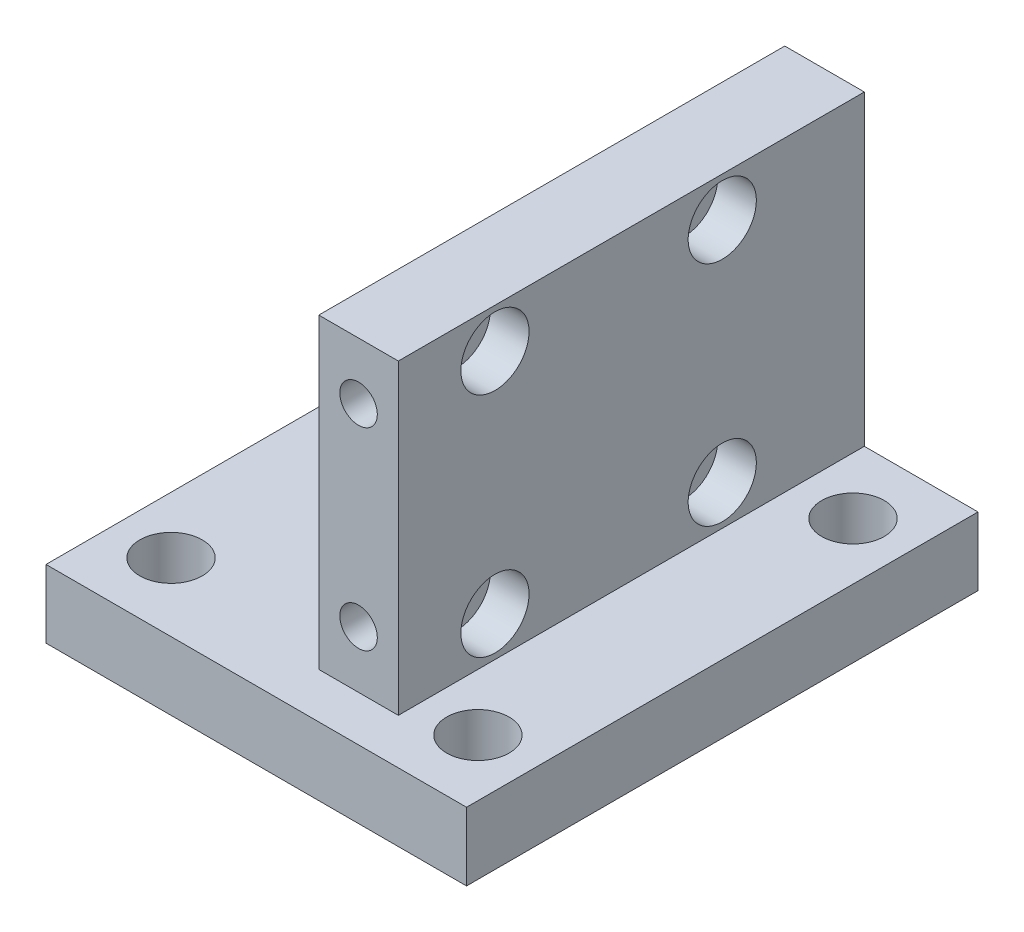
ISO-10303-21;
HEADER;
FILE_DESCRIPTION(('STEP AP214'),'2;1');
FILE_NAME('part.step','',(''),(''),'','','');
FILE_SCHEMA(('AUTOMOTIVE_DESIGN { 1 0 10303 214 1 1 1 1 }'));
ENDSEC;
DATA;
#1=APPLICATION_CONTEXT('core data for automotive mechanical design processes');
#2=APPLICATION_PROTOCOL_DEFINITION('international standard','automotive_design',2000,#1);
#3=PRODUCT_CONTEXT('',#1,'mechanical');
#4=PRODUCT('Part','Part','',(#3));
#5=PRODUCT_RELATED_PRODUCT_CATEGORY('part','',(#4));
#6=PRODUCT_DEFINITION_FORMATION('','',#4);
#7=PRODUCT_DEFINITION_CONTEXT('part definition',#1,'design');
#8=PRODUCT_DEFINITION('design','',#6,#7);
#9=PRODUCT_DEFINITION_SHAPE('','',#8);
#10=(LENGTH_UNIT() NAMED_UNIT(*) SI_UNIT(.MILLI.,.METRE.));
#11=(NAMED_UNIT(*) PLANE_ANGLE_UNIT() SI_UNIT($,.RADIAN.));
#12=(NAMED_UNIT(*) SI_UNIT($,.STERADIAN.) SOLID_ANGLE_UNIT());
#13=UNCERTAINTY_MEASURE_WITH_UNIT(LENGTH_MEASURE(1.E-05),#10,'distance_accuracy_value','');
#14=(GEOMETRIC_REPRESENTATION_CONTEXT(3) GLOBAL_UNCERTAINTY_ASSIGNED_CONTEXT((#13)) GLOBAL_UNIT_ASSIGNED_CONTEXT((#10,
#11,#12)) REPRESENTATION_CONTEXT('',''));
#15=CARTESIAN_POINT('',(0.,0.,0.));
#16=DIRECTION('',(0.,0.,1.));
#17=DIRECTION('',(1.,0.,0.));
#18=AXIS2_PLACEMENT_3D('',#15,#16,#17);
#19=CARTESIAN_POINT('',(-3.5,-5.50000000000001,32.9999999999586));
#20=DIRECTION('',(0.,0.,1.));
#21=DIRECTION('',(1.,0.,0.));
#22=AXIS2_PLACEMENT_3D('',#19,#20,#21);
#23=CONICAL_SURFACE('',#22,1.64999999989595,1.0297442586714);
#24=CARTESIAN_POINT('',(-5.14988037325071,-5.48013158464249,33.0000000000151));
#25=CARTESIAN_POINT('',(-5.08903634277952,-5.46814139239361,32.9635316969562));
#26=CARTESIAN_POINT('',(-5.0279651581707,-5.45757100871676,32.9270028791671));
#27=CARTESIAN_POINT('',(-4.90547698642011,-5.4391587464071,32.8538388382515));
#28=CARTESIAN_POINT('',(-4.84406000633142,-5.43131681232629,32.8172036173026));
#29=CARTESIAN_POINT('',(-4.65957283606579,-5.41172948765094,32.7072316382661));
#30=CARTESIAN_POINT('',(-4.53614393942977,-5.40389897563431,32.6337553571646));
#31=CARTESIAN_POINT('',(-4.34626715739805,-5.39964395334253,32.5206054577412));
#32=CARTESIAN_POINT('',(-4.27983239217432,-5.39962174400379,32.4809940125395));
#33=CARTESIAN_POINT('',(-4.14704181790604,-5.40252831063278,32.4017211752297));
#34=CARTESIAN_POINT('',(-4.08068601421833,-5.40545727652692,32.3620597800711));
#35=CARTESIAN_POINT('',(-3.9771803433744,-5.41238023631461,32.3000826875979));
#36=CARTESIAN_POINT('',(-3.93995589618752,-5.4153473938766,32.2777709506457));
#37=CARTESIAN_POINT('',(-3.86561234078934,-5.42224634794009,32.2331619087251));
#38=CARTESIAN_POINT('',(-3.82849318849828,-5.42617765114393,32.2108646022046));
#39=CARTESIAN_POINT('',(-3.77043204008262,-5.43310309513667,32.175963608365));
#40=CARTESIAN_POINT('',(-3.74945581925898,-5.43576424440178,32.1633497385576));
#41=CARTESIAN_POINT('',(-3.70750496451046,-5.44140628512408,32.1381260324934));
#42=CARTESIAN_POINT('',(-3.68653037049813,-5.44438760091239,32.1255162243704));
#43=CARTESIAN_POINT('',(-3.65357874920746,-5.44931614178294,32.1057481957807));
#44=CARTESIAN_POINT('',(-3.64159820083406,-5.45115894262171,32.0985697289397));
#45=CARTESIAN_POINT('',(-3.61767629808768,-5.45493276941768,32.0842818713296));
#46=CARTESIAN_POINT('',(-3.6057349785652,-5.45686341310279,32.0771723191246));
#47=CARTESIAN_POINT('',(-3.58683497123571,-5.45997365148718,32.066022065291));
#48=CARTESIAN_POINT('',(-3.57989235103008,-5.4611277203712,32.061947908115));
#49=CARTESIAN_POINT('',(-3.56588491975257,-5.4634616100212,32.0538297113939));
#50=CARTESIAN_POINT('',(-3.55881963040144,-5.4646415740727,32.049786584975));
#51=CARTESIAN_POINT('',(-3.54447707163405,-5.46700687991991,32.0417978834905));
#52=CARTESIAN_POINT('',(-3.53719821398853,-5.46819202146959,32.0378547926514));
#53=CARTESIAN_POINT('',(-3.52608635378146,-5.46981694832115,32.0325138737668));
#54=CARTESIAN_POINT('',(-3.5223936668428,-5.47032808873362,32.030845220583));
#55=CARTESIAN_POINT('',(-3.51482686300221,-5.47121812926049,32.0279531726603));
#56=CARTESIAN_POINT('',(-3.51095470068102,-5.47159818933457,32.0267258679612));
#57=CARTESIAN_POINT('',(-3.50589258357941,-5.47187429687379,32.0258355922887));
#58=CARTESIAN_POINT('',(-3.50480311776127,-5.47192125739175,32.025684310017));
#59=CARTESIAN_POINT('',(-3.50261428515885,-5.47198707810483,32.0254723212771));
#60=CARTESIAN_POINT('',(-3.50151491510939,-5.47200592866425,32.0254116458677));
#61=CARTESIAN_POINT('',(-3.49821885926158,-5.47201653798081,32.0253774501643));
#62=CARTESIAN_POINT('',(-3.49601887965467,-5.47196267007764,32.0255507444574));
#63=CARTESIAN_POINT('',(-3.48986421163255,-5.47166533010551,32.0265092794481));
#64=CARTESIAN_POINT('',(-3.48598589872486,-5.47130070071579,32.0276859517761));
#65=CARTESIAN_POINT('',(-3.47834672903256,-5.47042599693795,32.0305261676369));
#66=CARTESIAN_POINT('',(-3.47459175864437,-5.46991230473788,32.0322018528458));
#67=CARTESIAN_POINT('',(-3.4643905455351,-5.46843037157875,32.0370692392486));
#68=CARTESIAN_POINT('',(-3.45804374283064,-5.46741078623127,32.0404534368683));
#69=CARTESIAN_POINT('',(-3.44544064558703,-5.46534923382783,32.0473848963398));
#70=CARTESIAN_POINT('',(-3.43918447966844,-5.46430723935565,32.0509323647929));
#71=CARTESIAN_POINT('',(-3.42742939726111,-5.46234792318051,32.0576913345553));
#72=CARTESIAN_POINT('',(-3.42192602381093,-5.46143002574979,32.0608946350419));
#73=CARTESIAN_POINT('',(-3.41094788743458,-5.45960818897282,32.0673288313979));
#74=CARTESIAN_POINT('',(-3.40547308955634,-5.45870422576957,32.0705596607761));
#75=CARTESIAN_POINT('',(-3.39999999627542,-5.45781030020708,32.0737947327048));
#76=B_SPLINE_CURVE_WITH_KNOTS('',3,(#24,#25,#26,#27,#28,#29,#30,#31,#32,#33,#34,#35,#36,#37,#38,
#39,#40,#41,#42,#43,#44,#45,#46,#47,#48,#49,#50,#51,#52,#53,#54,#55,#56,#57,#58,#59,#60,#61,#62,
#63,#64,#65,#66,#67,#68,#69,#70,#71,#72,#73,#74,#75),.UNSPECIFIED.,.F.,.F.,(4,2,2,2,2,2,2,2,2,2,
2,2,2,2,2,2,2,2,2,2,2,2,2,2,2,4),(0.,0.215787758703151,0.431571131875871,0.862705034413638,
1.09470653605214,1.32672296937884,1.4572153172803,1.587641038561,1.661502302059,
1.73546269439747,1.777724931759,1.8198181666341,1.8442128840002,1.86889360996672,
1.89395697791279,1.90620992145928,1.91835147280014,1.92165006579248,1.92494978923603,
1.93153313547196,1.94363978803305,1.95606914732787,1.97784465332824,1.999648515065,
2.01894849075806,2.03821059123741),.UNSPECIFIED.);
#77=CARTESIAN_POINT('',(-5.14988037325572,-5.48013158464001,33.0000000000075));
#78=VERTEX_POINT('',#77);
#79=CARTESIAN_POINT('',(-3.4,-5.45781029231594,32.0737947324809));
#80=VERTEX_POINT('',#79);
#81=EDGE_CURVE('E135',#78,#80,#76,.T.);
#82=ORIENTED_EDGE('',*,*,#81,.T.);
#83=CARTESIAN_POINT('',(-3.4,-5.45781028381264,32.073794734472));
#84=CARTESIAN_POINT('',(-3.4,-5.44826143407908,32.0760537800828));
#85=CARTESIAN_POINT('',(-3.4,-5.43887635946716,32.0788624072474));
#86=CARTESIAN_POINT('',(-3.4,-5.42039601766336,32.0852375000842));
#87=CARTESIAN_POINT('',(-3.4,-5.41129991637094,32.088801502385));
#88=CARTESIAN_POINT('',(-3.4,-5.39332728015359,32.0963530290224));
#89=CARTESIAN_POINT('',(-3.4,-5.38445015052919,32.1003392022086));
#90=CARTESIAN_POINT('',(-3.4,-5.3668182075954,32.1085955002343));
#91=CARTESIAN_POINT('',(-3.4,-5.35806352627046,32.1128659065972));
#92=CARTESIAN_POINT('',(-3.4,-5.33216731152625,32.125826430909));
#93=CARTESIAN_POINT('',(-3.4,-5.3151555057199,32.134773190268));
#94=CARTESIAN_POINT('',(-3.4,-5.28131087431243,32.1530005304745));
#95=CARTESIAN_POINT('',(-3.4,-5.2644780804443,32.162281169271));
#96=CARTESIAN_POINT('',(-3.4,-5.21413655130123,32.1903935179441));
#97=CARTESIAN_POINT('',(-3.4,-5.18078046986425,32.2094978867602));
#98=CARTESIAN_POINT('',(-3.4,-5.11402004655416,32.248100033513));
#99=CARTESIAN_POINT('',(-3.4,-5.08061670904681,32.2675995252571));
#100=CARTESIAN_POINT('',(-3.4,-5.01389937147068,32.3067436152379));
#101=CARTESIAN_POINT('',(-3.4,-4.98058536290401,32.3263881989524));
#102=CARTESIAN_POINT('',(-3.4,-4.86982482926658,32.3918733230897));
#103=CARTESIAN_POINT('',(-3.4,-4.79247851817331,32.4378829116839));
#104=CARTESIAN_POINT('',(-3.4,-4.63786684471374,32.5300458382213));
#105=CARTESIAN_POINT('',(-3.4,-4.56060148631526,32.5761991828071));
#106=CARTESIAN_POINT('',(-3.4,-4.4071436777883,32.667961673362));
#107=CARTESIAN_POINT('',(-3.4,-4.33095065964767,32.7135698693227));
#108=CARTESIAN_POINT('',(-3.4,-4.1785930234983,32.8048247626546));
#109=CARTESIAN_POINT('',(-3.4,-4.10242840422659,32.850471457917));
#110=CARTESIAN_POINT('',(-3.4,-4.02626737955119,32.8961240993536));
#111=B_SPLINE_CURVE_WITH_KNOTS('',3,(#83,#84,#85,#86,#87,#88,#89,#90,#91,#92,#93,#94,#95,#96,
#97,#98,#99,#100,#101,#102,#103,#104,#105,#106,#107,#108,#109,#110),.UNSPECIFIED.,.F.,.F.,(4,2,
2,2,2,2,2,2,2,2,2,2,2,4),(0.,0.0293743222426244,0.058654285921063,0.0878432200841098,
0.117061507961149,0.174715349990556,0.232379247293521,0.347692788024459,0.463727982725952,
0.579751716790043,0.849740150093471,1.11974124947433,1.38614196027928,1.65252891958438),.UNSPECIFIED.);
#112=CARTESIAN_POINT('',(-3.40000000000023,-4.02626737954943,32.8961240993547));
#113=VERTEX_POINT('',#112);
#114=EDGE_CURVE('E21',#80,#113,#111,.T.);
#115=ORIENTED_EDGE('',*,*,#114,.T.);
#116=CARTESIAN_POINT('',(-3.40000000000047,-4.02626737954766,32.8961240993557));
#117=CARTESIAN_POINT('',(-3.34309934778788,-4.02655461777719,32.8982412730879));
#118=CARTESIAN_POINT('',(-3.28628883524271,-4.02708274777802,32.9022289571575));
#119=CARTESIAN_POINT('',(-3.17318478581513,-4.02864028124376,32.9135965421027));
#120=CARTESIAN_POINT('',(-3.11689020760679,-4.02966817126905,32.920966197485));
#121=CARTESIAN_POINT('',(-3.00483892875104,-4.03224552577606,32.9387611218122));
#122=CARTESIAN_POINT('',(-2.94908196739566,-4.0337947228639,32.949184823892));
#123=CARTESIAN_POINT('',(-2.837971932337,-4.03745057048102,32.9726978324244));
#124=CARTESIAN_POINT('',(-2.78262058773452,-4.03955889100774,32.9857950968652));
#125=CARTESIAN_POINT('',(-2.72758840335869,-4.04196010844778,33.0000000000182));
#126=B_SPLINE_CURVE_WITH_KNOTS('',3,(#116,#117,#118,#119,#120,#121,#122,#123,#124,#125),
.UNSPECIFIED.,.F.,.F.,(4,2,2,2,4),(0.,0.170763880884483,0.341013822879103,0.511176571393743,
0.681853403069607),.UNSPECIFIED.);
#127=CARTESIAN_POINT('',(-2.72758840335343,-4.04196010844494,33.0000000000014));
#128=VERTEX_POINT('',#127);
#129=EDGE_CURVE('E343',#113,#128,#126,.T.);
#130=ORIENTED_EDGE('',*,*,#129,.T.);
#131=CARTESIAN_POINT('',(-3.5,-5.50000000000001,33.));
#132=DIRECTION('',(0.,0.,1.));
#133=DIRECTION('',(1.,0.,0.));
#134=AXIS2_PLACEMENT_3D('',#131,#132,#133);
#135=CIRCLE('',#134,1.65);
#136=EDGE_CURVE('E141',#128,#78,#135,.T.);
#137=ORIENTED_EDGE('',*,*,#136,.T.);
#138=EDGE_LOOP('',(#82,#115,#130,#137));
#139=FACE_BOUND('',#138,.T.);
#140=ADVANCED_FACE('F17',(#139),#23,.F.);
#141=CARTESIAN_POINT('',(-3.4,-5.39999999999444,32.4999999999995));
#142=DIRECTION('',(-1.,0.,0.));
#143=DIRECTION('',(0.,0.,1.));
#144=AXIS2_PLACEMENT_3D('',#141,#142,#143);
#145=PLANE('',#144);
#146=DIRECTION('',(0.,0.,1.));
#147=VECTOR('',#146,1.);
#148=CARTESIAN_POINT('',(-3.4,-7.14696690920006,41.));
#149=LINE('',#148,#147);
#150=CARTESIAN_POINT('',(-3.4,-7.14696690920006,34.0932359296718));
#151=VERTEX_POINT('',#150);
#152=CARTESIAN_POINT('',(-3.4,-7.14696690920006,35.4963979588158));
#153=VERTEX_POINT('',#152);
#154=EDGE_CURVE('E344',#151,#153,#149,.T.);
#155=ORIENTED_EDGE('',*,*,#154,.T.);
#156=CARTESIAN_POINT('',(-3.4,-6.99999999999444,32.4999999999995));
#157=DIRECTION('',(1.,0.,0.));
#158=DIRECTION('',(0.,0.,-1.));
#159=AXIS2_PLACEMENT_3D('',#156,#157,#158);
#160=CIRCLE('',#159,3.);
#161=EDGE_CURVE('E126',#153,#113,#160,.T.);
#162=ORIENTED_EDGE('',*,*,#161,.T.);
#163=ORIENTED_EDGE('',*,*,#114,.F.);
#164=CARTESIAN_POINT('',(-3.4,-6.99999999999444,32.4999999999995));
#165=DIRECTION('',(1.,0.,0.));
#166=DIRECTION('',(0.,0.,-1.));
#167=AXIS2_PLACEMENT_3D('',#164,#165,#166);
#168=CIRCLE('',#167,1.6);
#169=EDGE_CURVE('E124',#80,#151,#168,.F.);
#170=ORIENTED_EDGE('',*,*,#169,.T.);
#171=EDGE_LOOP('',(#155,#162,#163,#170));
#172=FACE_BOUND('',#171,.T.);
#173=ADVANCED_FACE('F123',(#172),#145,.F.);
#174=CARTESIAN_POINT('',(-3.4,-5.39999999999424,12.4999999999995));
#175=DIRECTION('',(-1.,0.,0.));
#176=DIRECTION('',(0.,0.,1.));
#177=AXIS2_PLACEMENT_3D('',#174,#175,#176);
#178=PLANE('',#177);
#179=CARTESIAN_POINT('',(-3.4,-6.99999999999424,12.4999999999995));
#180=DIRECTION('',(1.,0.,0.));
#181=DIRECTION('',(0.,0.,-1.));
#182=AXIS2_PLACEMENT_3D('',#179,#180,#181);
#183=CIRCLE('',#182,3.);
#184=CARTESIAN_POINT('',(-3.4,-6.99999999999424,9.49999999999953));
#185=VERTEX_POINT('',#184);
#186=EDGE_CURVE('E491',#185,#185,#183,.T.);
#187=ORIENTED_EDGE('',*,*,#186,.T.);
#188=EDGE_LOOP('',(#187));
#189=FACE_BOUND('',#188,.T.);
#190=CARTESIAN_POINT('',(-3.4,-6.99999999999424,12.4999999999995));
#191=DIRECTION('',(1.,0.,0.));
#192=DIRECTION('',(0.,0.,-1.));
#193=AXIS2_PLACEMENT_3D('',#190,#191,#192);
#194=CIRCLE('',#193,1.6);
#195=CARTESIAN_POINT('',(-3.4,-6.99999999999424,10.8999999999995));
#196=VERTEX_POINT('',#195);
#197=EDGE_CURVE('E138',#196,#196,#194,.F.);
#198=ORIENTED_EDGE('',*,*,#197,.T.);
#199=EDGE_LOOP('',(#198));
#200=FACE_BOUND('',#199,.T.);
#201=ADVANCED_FACE('F546',(#189,#200),#178,.F.);
#202=CARTESIAN_POINT('',(-3.4,14.6000000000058,12.4999999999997));
#203=DIRECTION('',(-1.,0.,0.));
#204=DIRECTION('',(0.,0.,1.));
#205=AXIS2_PLACEMENT_3D('',#202,#203,#204);
#206=PLANE('',#205);
#207=CARTESIAN_POINT('',(-3.4,13.0000000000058,12.4999999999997));
#208=DIRECTION('',(1.,0.,0.));
#209=DIRECTION('',(0.,0.,-1.));
#210=AXIS2_PLACEMENT_3D('',#207,#208,#209);
#211=CIRCLE('',#210,3.);
#212=CARTESIAN_POINT('',(-3.4,13.0000000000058,9.49999999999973));
#213=VERTEX_POINT('',#212);
#214=EDGE_CURVE('E185',#213,#213,#211,.T.);
#215=ORIENTED_EDGE('',*,*,#214,.T.);
#216=EDGE_LOOP('',(#215));
#217=FACE_BOUND('',#216,.T.);
#218=CARTESIAN_POINT('',(-3.4,13.0000000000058,12.4999999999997));
#219=DIRECTION('',(1.,0.,0.));
#220=DIRECTION('',(0.,0.,-1.));
#221=AXIS2_PLACEMENT_3D('',#218,#219,#220);
#222=CIRCLE('',#221,1.6);
#223=CARTESIAN_POINT('',(-3.4,13.0000000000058,10.8999999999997));
#224=VERTEX_POINT('',#223);
#225=EDGE_CURVE('E209',#224,#224,#222,.F.);
#226=ORIENTED_EDGE('',*,*,#225,.T.);
#227=EDGE_LOOP('',(#226));
#228=FACE_BOUND('',#227,.T.);
#229=ADVANCED_FACE('F193',(#217,#228),#206,.F.);
#230=CARTESIAN_POINT('',(-3.5,11.5,32.9999999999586));
#231=DIRECTION('',(0.,0.,1.));
#232=DIRECTION('',(1.,0.,0.));
#233=AXIS2_PLACEMENT_3D('',#230,#231,#232);
#234=CONICAL_SURFACE('',#233,1.64999999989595,1.02974425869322);
#235=CARTESIAN_POINT('',(-2.72758840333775,10.0419601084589,33.0000000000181));
#236=CARTESIAN_POINT('',(-2.78262058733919,10.0395588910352,32.9857950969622));
#237=CARTESIAN_POINT('',(-2.83797193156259,10.0374505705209,32.9726978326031));
#238=CARTESIAN_POINT('',(-2.94908196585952,10.0337947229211,32.9491848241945));
#239=CARTESIAN_POINT('',(-3.00483892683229,10.0322455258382,32.9387611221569));
#240=CARTESIAN_POINT('',(-3.11689020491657,10.0296681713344,32.920966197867));
#241=CARTESIAN_POINT('',(-3.17318478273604,10.0286402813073,32.9135965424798));
#242=CARTESIAN_POINT('',(-3.28628883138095,10.0270827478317,32.9022289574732));
#243=CARTESIAN_POINT('',(-3.3430993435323,10.0265546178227,32.8982412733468));
#244=CARTESIAN_POINT('',(-3.39999999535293,10.0262673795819,32.8961240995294));
#245=B_SPLINE_CURVE_WITH_KNOTS('',3,(#235,#236,#237,#238,#239,#240,#241,#242,#243,#244),
.UNSPECIFIED.,.F.,.F.,(4,2,2,2,4),(0.,0.170676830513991,0.340839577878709,0.511089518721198,
0.68185339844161),.UNSPECIFIED.);
#246=CARTESIAN_POINT('',(-2.72758840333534,10.0419601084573,33.0000000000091));
#247=VERTEX_POINT('',#246);
#248=CARTESIAN_POINT('',(-3.4,10.0262674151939,32.8961240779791));
#249=VERTEX_POINT('',#248);
#250=EDGE_CURVE('E177',#247,#249,#245,.T.);
#251=ORIENTED_EDGE('',*,*,#250,.T.);
#252=CARTESIAN_POINT('',(-3.4,10.0262674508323,32.896124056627));
#253=CARTESIAN_POINT('',(-3.4,10.0852729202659,32.8607525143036));
#254=CARTESIAN_POINT('',(-3.4,10.1442817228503,32.8253865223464));
#255=CARTESIAN_POINT('',(-3.4,10.2623043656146,32.7546805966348));
#256=CARTESIAN_POINT('',(-3.4,10.3213182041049,32.7193406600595));
#257=CARTESIAN_POINT('',(-3.4,10.4393462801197,32.6487035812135));
#258=CARTESIAN_POINT('',(-3.4,10.4983605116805,32.6134064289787));
#259=CARTESIAN_POINT('',(-3.4,10.6164277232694,32.5428596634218));
#260=CARTESIAN_POINT('',(-3.4,10.6754807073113,32.5076100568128));
#261=CARTESIAN_POINT('',(-3.4,10.7641229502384,32.4547976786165));
#262=CARTESIAN_POINT('',(-3.4,10.7936903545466,32.4371982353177));
#263=CARTESIAN_POINT('',(-3.4,10.8528445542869,32.4020364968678));
#264=CARTESIAN_POINT('',(-3.4,10.8824313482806,32.3844741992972));
#265=CARTESIAN_POINT('',(-3.4,10.9416239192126,32.3494109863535));
#266=CARTESIAN_POINT('',(-3.4,10.9712296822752,32.3319100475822));
#267=CARTESIAN_POINT('',(-3.4,11.0304996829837,32.2969910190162));
#268=CARTESIAN_POINT('',(-3.4,11.0601639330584,32.2795729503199));
#269=CARTESIAN_POINT('',(-3.4,11.1196245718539,32.2448596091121));
#270=CARTESIAN_POINT('',(-3.4,11.149421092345,32.2275645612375));
#271=CARTESIAN_POINT('',(-3.4,11.1942344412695,32.2018605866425));
#272=CARTESIAN_POINT('',(-3.4,11.2091850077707,32.1933362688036));
#273=CARTESIAN_POINT('',(-3.4,11.2391590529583,32.1764035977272));
#274=CARTESIAN_POINT('',(-3.4,11.25418255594,32.1679952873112));
#275=CARTESIAN_POINT('',(-3.4,11.2843818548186,32.1513460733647));
#276=CARTESIAN_POINT('',(-3.4,11.2995579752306,32.1431057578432));
#277=CARTESIAN_POINT('',(-3.4,11.3300743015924,32.1269674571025));
#278=CARTESIAN_POINT('',(-3.4,11.3454143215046,32.1190691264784));
#279=CARTESIAN_POINT('',(-3.4,11.368705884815,32.1077092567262));
#280=CARTESIAN_POINT('',(-3.4,11.37653376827,32.1039964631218));
#281=CARTESIAN_POINT('',(-3.4,11.3923016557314,32.0968314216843));
#282=CARTESIAN_POINT('',(-3.4,11.4002415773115,32.0933789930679));
#283=CARTESIAN_POINT('',(-3.4,11.416315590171,32.0868471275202));
#284=CARTESIAN_POINT('',(-3.4,11.4244503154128,32.0837691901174));
#285=CARTESIAN_POINT('',(-3.4,11.4409503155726,32.0782430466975));
#286=CARTESIAN_POINT('',(-3.4,11.4493161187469,32.0757964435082));
#287=CARTESIAN_POINT('',(-3.4,11.4578103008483,32.0737947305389));
#288=B_SPLINE_CURVE_WITH_KNOTS('',3,(#252,#253,#254,#255,#256,#257,#258,#259,#260,#261,#262,
#263,#264,#265,#266,#267,#268,#269,#270,#271,#272,#273,#274,#275,#276,#277,#278,#279,#280,#281,
#282,#283,#284,#285,#286,#287),.UNSPECIFIED.,.F.,.F.,(4,2,2,2,2,2,2,2,2,2,2,2,2,2,2,2,2,4),(0.,
0.206385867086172,0.412744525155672,0.619038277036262,0.825358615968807,0.928585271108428,
1.03180498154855,1.13497974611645,1.23817950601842,1.34153480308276,1.39316446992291,
1.44481271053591,1.49661828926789,1.54837026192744,1.57435805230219,1.60032762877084,
1.6263979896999,1.65253390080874),.UNSPECIFIED.);
#289=CARTESIAN_POINT('',(-3.4000000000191,11.4578103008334,32.0737947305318));
#290=VERTEX_POINT('',#289);
#291=EDGE_CURVE('E131',#249,#290,#288,.T.);
#292=ORIENTED_EDGE('',*,*,#291,.T.);
#293=CARTESIAN_POINT('',(-3.40000000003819,11.4578103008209,32.0737947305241));
#294=CARTESIAN_POINT('',(-3.40725085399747,11.4589937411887,32.0695117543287));
#295=CARTESIAN_POINT('',(-3.41449919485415,11.4601951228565,32.0652352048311));
#296=CARTESIAN_POINT('',(-3.42934283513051,11.462665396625,32.0565776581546));
#297=CARTESIAN_POINT('',(-3.43693987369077,11.463934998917,32.0521998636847));
#298=CARTESIAN_POINT('',(-3.45222181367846,11.4664689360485,32.0435988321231));
#299=CARTESIAN_POINT('',(-3.45990662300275,11.4677332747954,32.0393754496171));
#300=CARTESIAN_POINT('',(-3.47161196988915,11.4694897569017,32.0335855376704));
#301=CARTESIAN_POINT('',(-3.47549841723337,11.4700463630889,32.0317641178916));
#302=CARTESIAN_POINT('',(-3.48345326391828,11.4710363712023,32.0285416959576));
#303=CARTESIAN_POINT('',(-3.4875198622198,11.47147076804,32.0271372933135));
#304=CARTESIAN_POINT('',(-3.49279578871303,11.4718063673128,32.0260545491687));
#305=CARTESIAN_POINT('',(-3.49388324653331,11.4718639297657,32.0258690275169));
#306=CARTESIAN_POINT('',(-3.49607065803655,11.4719520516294,32.0255851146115));
#307=CARTESIAN_POINT('',(-3.49717061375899,11.4719826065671,32.0254867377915));
#308=CARTESIAN_POINT('',(-3.5004639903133,11.472028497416,32.0253389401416));
#309=CARTESIAN_POINT('',(-3.50266645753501,11.4719991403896,32.0254333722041));
#310=CARTESIAN_POINT('',(-3.50789614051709,11.4717972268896,32.0260839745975));
#311=CARTESIAN_POINT('',(-3.51089720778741,11.471571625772,32.0268112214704));
#312=CARTESIAN_POINT('',(-3.51679608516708,11.4710014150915,32.0286569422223));
#313=CARTESIAN_POINT('',(-3.51969171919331,11.4706550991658,32.02978102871));
#314=CARTESIAN_POINT('',(-3.52906456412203,11.4694351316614,32.0337604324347));
#315=CARTESIAN_POINT('',(-3.53536408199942,11.4684555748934,32.036984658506));
#316=CARTESIAN_POINT('',(-3.54784211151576,11.4664558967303,32.0436501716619));
#317=CARTESIAN_POINT('',(-3.5540203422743,11.4654356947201,32.0470918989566));
#318=CARTESIAN_POINT('',(-3.56628965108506,11.4633969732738,32.0540581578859));
#319=CARTESIAN_POINT('',(-3.57238101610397,11.4623784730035,32.0575821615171));
#320=CARTESIAN_POINT('',(-3.58453271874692,11.4603562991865,32.0646714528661));
#321=CARTESIAN_POINT('',(-3.59059308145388,11.4593526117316,32.0682366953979));
#322=CARTESIAN_POINT('',(-3.62078827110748,11.4543999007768,32.0860692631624));
#323=CARTESIAN_POINT('',(-3.64485225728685,11.4506061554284,32.1005012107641));
#324=CARTESIAN_POINT('',(-3.69302010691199,11.4434347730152,32.1294220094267));
#325=CARTESIAN_POINT('',(-3.71712398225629,11.4400572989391,32.1439108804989));
#326=CARTESIAN_POINT('',(-3.76541257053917,11.4337131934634,32.1729426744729));
#327=CARTESIAN_POINT('',(-3.78959735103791,11.4307473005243,32.1874856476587));
#328=CARTESIAN_POINT('',(-3.83800740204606,11.4252328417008,32.2165788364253));
#329=CARTESIAN_POINT('',(-3.86223267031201,11.4226842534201,32.2311290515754));
#330=CARTESIAN_POINT('',(-3.9918020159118,11.4101630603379,32.3088949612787));
#331=CARTESIAN_POINT('',(-4.09751012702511,11.4038639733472,32.3721413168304));
#332=CARTESIAN_POINT('',(-4.30920131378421,11.3987502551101,32.4985364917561));
#333=CARTESIAN_POINT('',(-4.41518448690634,11.3999387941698,32.5616852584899));
#334=CARTESIAN_POINT('',(-4.6264687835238,11.4097811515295,32.6875400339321));
#335=CARTESIAN_POINT('',(-4.73177088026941,11.4184028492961,32.7502467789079));
#336=CARTESIAN_POINT('',(-4.88912284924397,11.4371117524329,32.8440869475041));
#337=CARTESIAN_POINT('',(-4.94146552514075,11.4443092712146,32.8753256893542));
#338=CARTESIAN_POINT('',(-5.04588846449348,11.4607030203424,32.93772479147));
#339=CARTESIAN_POINT('',(-5.09796870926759,11.4698993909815,32.9688851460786));
#340=CARTESIAN_POINT('',(-5.14988037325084,11.4801315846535,33.0000000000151));
#341=B_SPLINE_CURVE_WITH_KNOTS('',3,(#293,#294,#295,#296,#297,#298,#299,#300,#301,#302,#303,
#304,#305,#306,#307,#308,#309,#310,#311,#312,#313,#314,#315,#316,#317,#318,#319,#320,#321,#322,
#323,#324,#325,#326,#327,#328,#329,#330,#331,#332,#333,#334,#335,#336,#337,#338,#339,#340),
.UNSPECIFIED.,.F.,.F.,(4,2,2,2,2,2,2,2,2,2,2,2,2,2,2,2,2,2,2,2,2,2,2,4),(0.,0.0255061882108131,
0.0520881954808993,0.0786444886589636,0.0916313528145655,0.104509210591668,0.107819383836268,
0.111130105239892,0.117704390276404,0.126933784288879,0.136299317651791,0.157696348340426,
0.179138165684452,0.200467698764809,0.221775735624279,0.306716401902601,0.391690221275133,
0.476814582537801,0.561934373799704,0.931697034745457,1.30161626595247,1.6699449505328,
1.85405422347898,2.03817642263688),.UNSPECIFIED.);
#342=CARTESIAN_POINT('',(-5.14988037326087,11.480131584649,33.0000000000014));
#343=VERTEX_POINT('',#342);
#344=EDGE_CURVE('E200',#290,#343,#341,.T.);
#345=ORIENTED_EDGE('',*,*,#344,.T.);
#346=CARTESIAN_POINT('',(-3.5,11.5,33.));
#347=DIRECTION('',(0.,0.,1.));
#348=DIRECTION('',(1.,0.,0.));
#349=AXIS2_PLACEMENT_3D('',#346,#347,#348);
#350=CIRCLE('',#349,1.65);
#351=EDGE_CURVE('E332',#343,#247,#350,.T.);
#352=ORIENTED_EDGE('',*,*,#351,.T.);
#353=EDGE_LOOP('',(#251,#292,#345,#352));
#354=FACE_BOUND('',#353,.T.);
#355=ADVANCED_FACE('F187',(#354),#234,.F.);
#356=CARTESIAN_POINT('',(-3.4,14.6000000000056,32.4999999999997));
#357=DIRECTION('',(-1.,0.,0.));
#358=DIRECTION('',(0.,0.,1.));
#359=AXIS2_PLACEMENT_3D('',#356,#357,#358);
#360=PLANE('',#359);
#361=CARTESIAN_POINT('',(-3.4,13.0000000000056,32.4999999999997));
#362=DIRECTION('',(1.,0.,0.));
#363=DIRECTION('',(0.,0.,-1.));
#364=AXIS2_PLACEMENT_3D('',#361,#362,#363);
#365=CIRCLE('',#364,3.);
#366=CARTESIAN_POINT('',(-3.4,13.1469669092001,35.4963979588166));
#367=VERTEX_POINT('',#366);
#368=EDGE_CURVE('E184',#249,#367,#365,.T.);
#369=ORIENTED_EDGE('',*,*,#368,.T.);
#370=DIRECTION('',(0.,0.,1.));
#371=VECTOR('',#370,1.);
#372=CARTESIAN_POINT('',(-3.4,13.1469669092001,41.));
#373=LINE('',#372,#371);
#374=CARTESIAN_POINT('',(-3.4,13.1469669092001,34.093235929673));
#375=VERTEX_POINT('',#374);
#376=EDGE_CURVE('E329',#367,#375,#373,.F.);
#377=ORIENTED_EDGE('',*,*,#376,.T.);
#378=CARTESIAN_POINT('',(-3.4,13.0000000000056,32.4999999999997));
#379=DIRECTION('',(1.,0.,0.));
#380=DIRECTION('',(0.,0.,-1.));
#381=AXIS2_PLACEMENT_3D('',#378,#379,#380);
#382=CIRCLE('',#381,1.6);
#383=EDGE_CURVE('E320',#375,#290,#382,.F.);
#384=ORIENTED_EDGE('',*,*,#383,.T.);
#385=ORIENTED_EDGE('',*,*,#291,.F.);
#386=EDGE_LOOP('',(#369,#377,#384,#385));
#387=FACE_BOUND('',#386,.T.);
#388=ADVANCED_FACE('F192',(#387),#360,.F.);
#389=CARTESIAN_POINT('',(-3.5,11.5,41.));
#390=DIRECTION('',(0.,0.,1.));
#391=DIRECTION('',(1.,0.,0.));
#392=AXIS2_PLACEMENT_3D('',#389,#390,#391);
#393=CYLINDRICAL_SURFACE('',#392,1.65);
#394=CARTESIAN_POINT('',(-3.5,11.5,41.));
#395=DIRECTION('',(0.,0.,1.));
#396=DIRECTION('',(1.,0.,0.));
#397=AXIS2_PLACEMENT_3D('',#394,#395,#396);
#398=CIRCLE('',#397,1.65);
#399=CARTESIAN_POINT('',(-1.85,11.5,41.));
#400=VERTEX_POINT('',#399);
#401=EDGE_CURVE('E315',#400,#400,#398,.F.);
#402=ORIENTED_EDGE('',*,*,#401,.F.);
#403=EDGE_LOOP('',(#402));
#404=FACE_BOUND('',#403,.T.);
#405=ORIENTED_EDGE('',*,*,#351,.F.);
#406=CARTESIAN_POINT('',(-5.14988037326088,11.4801315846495,33.0000000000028));
#407=CARTESIAN_POINT('',(-5.14995339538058,11.4863936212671,33.019041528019));
#408=CARTESIAN_POINT('',(-5.14999843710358,11.4930186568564,33.0379720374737));
#409=CARTESIAN_POINT('',(-5.15000646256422,11.5288677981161,33.134532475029));
#410=CARTESIAN_POINT('',(-5.14926951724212,11.5638277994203,33.2101322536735));
#411=CARTESIAN_POINT('',(-5.14411175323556,11.6450735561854,33.3550413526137));
#412=CARTESIAN_POINT('',(-5.13968299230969,11.6913835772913,33.4243367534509));
#413=CARTESIAN_POINT('',(-5.12441206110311,11.7940888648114,33.5548426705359));
#414=CARTESIAN_POINT('',(-5.11353957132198,11.8505309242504,33.6160132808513));
#415=CARTESIAN_POINT('',(-5.08261765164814,11.9707967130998,33.7277842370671));
#416=CARTESIAN_POINT('',(-5.06258422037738,12.0346074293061,33.7784027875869));
#417=CARTESIAN_POINT('',(-5.01362588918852,12.1599525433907,33.8636488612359));
#418=CARTESIAN_POINT('',(-4.98567958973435,12.2211629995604,33.899314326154));
#419=CARTESIAN_POINT('',(-4.91991027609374,12.343300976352,33.9606220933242));
#420=CARTESIAN_POINT('',(-4.88208744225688,12.4042285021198,33.9862645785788));
#421=CARTESIAN_POINT('',(-4.80023543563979,12.518054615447,34.0267980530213));
#422=CARTESIAN_POINT('',(-4.75688657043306,12.5712124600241,34.0423523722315));
#423=CARTESIAN_POINT('',(-4.66303716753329,12.6724383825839,34.0669780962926));
#424=CARTESIAN_POINT('',(-4.61253549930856,12.7205056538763,34.0760484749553));
#425=CARTESIAN_POINT('',(-4.5028792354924,12.8122857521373,34.0896617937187));
#426=CARTESIAN_POINT('',(-4.44342271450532,12.8556717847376,34.0939622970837));
#427=CARTESIAN_POINT('',(-4.31913195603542,12.9342029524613,34.0991314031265));
#428=CARTESIAN_POINT('',(-4.25429304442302,12.9693408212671,34.0999969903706));
#429=CARTESIAN_POINT('',(-4.10312172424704,13.0386132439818,34.1000037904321));
#430=CARTESIAN_POINT('',(-4.01557723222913,13.0701224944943,34.0986393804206));
#431=CARTESIAN_POINT('',(-3.83646985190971,13.1179828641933,34.0958271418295));
#432=CARTESIAN_POINT('',(-3.74490951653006,13.1343434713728,34.0943793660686));
#433=CARTESIAN_POINT('',(-3.61067541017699,13.1468272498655,34.0932508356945));
#434=CARTESIAN_POINT('',(-3.56850544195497,13.1491179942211,34.0930372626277));
#435=CARTESIAN_POINT('',(-3.48419702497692,13.1504611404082,34.0929088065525));
#436=CARTESIAN_POINT('',(-3.44205867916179,13.1495199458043,34.0929933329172));
#437=CARTESIAN_POINT('',(-3.4,13.1469669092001,34.093235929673));
#438=B_SPLINE_CURVE_WITH_KNOTS('',3,(#406,#407,#408,#409,#410,#411,#412,#413,#414,#415,#416,
#417,#418,#419,#420,#421,#422,#423,#424,#425,#426,#427,#428,#429,#430,#431,#432,#433,#434,#435,
#436,#437),.UNSPECIFIED.,.F.,.F.,(4,2,2,2,2,2,2,2,2,2,2,2,2,2,2,4),(0.,0.0601525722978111,
0.308882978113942,0.558149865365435,0.808599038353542,1.05861248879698,1.28580335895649,
1.5129900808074,1.72309806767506,1.93323930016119,2.15363143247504,2.37421699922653,
2.65203019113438,2.92966926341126,3.05626121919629,3.18260249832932),.UNSPECIFIED.);
#439=EDGE_CURVE('E208',#343,#375,#438,.T.);
#440=ORIENTED_EDGE('',*,*,#439,.T.);
#441=ORIENTED_EDGE('',*,*,#376,.F.);
#442=CARTESIAN_POINT('',(-3.4,13.1469669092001,35.4963979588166));
#443=CARTESIAN_POINT('',(-3.34932110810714,13.1438963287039,35.4965374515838));
#444=CARTESIAN_POINT('',(-3.29878837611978,13.1384739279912,35.4968095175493));
#445=CARTESIAN_POINT('',(-3.19843441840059,13.123000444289,35.4974903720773));
#446=CARTESIAN_POINT('',(-3.14861323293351,13.11294910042,35.4978991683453));
#447=CARTESIAN_POINT('',(-3.0501543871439,13.0883048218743,35.4987246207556));
#448=CARTESIAN_POINT('',(-3.0015156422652,13.0737162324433,35.499141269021));
#449=CARTESIAN_POINT('',(-2.90580462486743,13.0401320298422,35.499778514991));
#450=CARTESIAN_POINT('',(-2.85873212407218,13.0211370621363,35.499999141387));
#451=CARTESIAN_POINT('',(-2.73118934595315,12.9626815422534,35.5000015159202));
#452=CARTESIAN_POINT('',(-2.65273888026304,12.9186858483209,35.499317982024));
#453=CARTESIAN_POINT('',(-2.50414134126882,12.8186320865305,35.4949291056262));
#454=CARTESIAN_POINT('',(-2.43398907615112,12.7625816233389,35.4912256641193));
#455=CARTESIAN_POINT('',(-2.30372586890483,12.639930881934,35.4789509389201));
#456=CARTESIAN_POINT('',(-2.24363962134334,12.5733054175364,35.470367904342));
#457=CARTESIAN_POINT('',(-2.13549136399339,12.4319490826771,35.4465976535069));
#458=CARTESIAN_POINT('',(-2.08742727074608,12.3572196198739,35.4314115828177));
#459=CARTESIAN_POINT('',(-2.00615131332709,12.2057027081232,35.3939483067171));
#460=CARTESIAN_POINT('',(-1.97242590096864,12.1291145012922,35.3719763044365));
#461=CARTESIAN_POINT('',(-1.91745404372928,11.974132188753,35.3203278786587));
#462=CARTESIAN_POINT('',(-1.89620031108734,11.8957391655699,35.2906559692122));
#463=CARTESIAN_POINT('',(-1.8703144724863,11.7639266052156,35.2341515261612));
#464=CARTESIAN_POINT('',(-1.86257994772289,11.7102464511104,35.2092556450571));
#465=CARTESIAN_POINT('',(-1.85242393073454,11.6040789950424,35.156110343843));
#466=CARTESIAN_POINT('',(-1.85000059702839,11.5515912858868,35.1278620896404));
#467=CARTESIAN_POINT('',(-1.84999940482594,11.4485689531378,35.0683828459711));
#468=CARTESIAN_POINT('',(-1.85240651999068,11.3980287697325,35.0371613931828));
#469=CARTESIAN_POINT('',(-1.86151741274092,11.2991444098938,34.9719637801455));
#470=CARTESIAN_POINT('',(-1.86822370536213,11.2508015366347,34.9379860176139));
#471=CARTESIAN_POINT('',(-1.89404681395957,11.1093448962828,34.8322259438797));
#472=CARTESIAN_POINT('',(-1.91886394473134,11.0200016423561,34.7567322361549));
#473=CARTESIAN_POINT('',(-1.98938221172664,10.8259229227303,34.572822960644));
#474=CARTESIAN_POINT('',(-2.0392265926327,10.7254244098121,34.4616080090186));
#475=CARTESIAN_POINT('',(-2.15084681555,10.5441674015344,34.2293591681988));
#476=CARTESIAN_POINT('',(-2.2126494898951,10.4634542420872,34.1083035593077));
#477=CARTESIAN_POINT('',(-2.31052103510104,10.3553915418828,33.918316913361));
#478=CARTESIAN_POINT('',(-2.34469753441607,10.321027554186,33.8522673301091));
#479=CARTESIAN_POINT('',(-2.41346725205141,10.2573665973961,33.7179836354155));
#480=CARTESIAN_POINT('',(-2.44806036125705,10.2280683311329,33.6497500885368));
#481=CARTESIAN_POINT('',(-2.51630626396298,10.1745874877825,33.5112076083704));
#482=CARTESIAN_POINT('',(-2.54996205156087,10.1503864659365,33.4409072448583));
#483=CARTESIAN_POINT('',(-2.61476839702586,10.1070261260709,33.2976812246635));
#484=CARTESIAN_POINT('',(-2.64592155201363,10.087861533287,33.224758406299));
#485=CARTESIAN_POINT('',(-2.68402025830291,10.0658453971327,33.1255992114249));
#486=CARTESIAN_POINT('',(-2.69322671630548,10.0606529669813,33.1007409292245));
#487=CARTESIAN_POINT('',(-2.71095531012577,10.0508586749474,33.0506516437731));
#488=CARTESIAN_POINT('',(-2.71947707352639,10.0462571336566,33.0254204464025));
#489=CARTESIAN_POINT('',(-2.72758840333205,10.0419601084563,33.0000000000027));
#490=B_SPLINE_CURVE_WITH_KNOTS('',3,(#442,#443,#444,#445,#446,#447,#448,#449,#450,#451,#452,
#453,#454,#455,#456,#457,#458,#459,#460,#461,#462,#463,#464,#465,#466,#467,#468,#469,#470,#471,
#472,#473,#474,#475,#476,#477,#478,#479,#480,#481,#482,#483,#484,#485,#486,#487,#488,#489),
.UNSPECIFIED.,.F.,.F.,(4,2,2,2,2,2,2,2,2,2,2,2,2,2,2,2,2,2,2,2,2,2,2,4),(0.,0.152256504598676,
0.30452159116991,0.456641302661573,0.608738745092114,0.87727379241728,1.14563993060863,
1.41465509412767,1.68362360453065,1.94192215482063,2.20006961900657,2.37876815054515,
2.55740471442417,2.7354864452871,2.91367244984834,3.27072347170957,3.74214789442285,
4.2146426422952,4.46026594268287,4.70582625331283,4.95048211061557,5.19488070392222,
5.27590202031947,5.35696711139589),.UNSPECIFIED.);
#491=EDGE_CURVE('E143',#367,#247,#490,.T.);
#492=ORIENTED_EDGE('',*,*,#491,.T.);
#493=EDGE_LOOP('',(#405,#440,#441,#492));
#494=FACE_BOUND('',#493,.T.);
#495=ADVANCED_FACE('F328',(#404,#494),#393,.F.);
#496=CARTESIAN_POINT('',(-3.5,-5.50000000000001,41.));
#497=DIRECTION('',(0.,0.,1.));
#498=DIRECTION('',(1.,0.,0.));
#499=AXIS2_PLACEMENT_3D('',#496,#497,#498);
#500=CYLINDRICAL_SURFACE('',#499,1.65);
#501=CARTESIAN_POINT('',(-3.5,-5.50000000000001,41.));
#502=DIRECTION('',(0.,0.,1.));
#503=DIRECTION('',(1.,0.,0.));
#504=AXIS2_PLACEMENT_3D('',#501,#502,#503);
#505=CIRCLE('',#504,1.65);
#506=CARTESIAN_POINT('',(-1.85,-5.50000000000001,41.));
#507=VERTEX_POINT('',#506);
#508=EDGE_CURVE('E311',#507,#507,#505,.F.);
#509=ORIENTED_EDGE('',*,*,#508,.F.);
#510=EDGE_LOOP('',(#509));
#511=FACE_BOUND('',#510,.T.);
#512=ORIENTED_EDGE('',*,*,#154,.F.);
#513=CARTESIAN_POINT('',(-3.4,-7.14696690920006,34.0932359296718));
#514=CARTESIAN_POINT('',(-3.4463888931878,-7.14978873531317,34.092959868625));
#515=CARTESIAN_POINT('',(-3.49289763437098,-7.15064050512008,34.0928889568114));
#516=CARTESIAN_POINT('',(-3.58583685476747,-7.14842010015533,34.0931058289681));
#517=CARTESIAN_POINT('',(-3.63226730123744,-7.14534656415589,34.0933937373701));
#518=CARTESIAN_POINT('',(-3.72442146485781,-7.13532001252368,34.094274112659));
#519=CARTESIAN_POINT('',(-3.77014775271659,-7.12839043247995,34.0948647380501));
#520=CARTESIAN_POINT('',(-3.86083423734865,-7.11072391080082,34.096189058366));
#521=CARTESIAN_POINT('',(-3.90579478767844,-7.09998877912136,34.0969226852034));
#522=CARTESIAN_POINT('',(-3.99077369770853,-7.07588611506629,34.0982407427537));
#523=CARTESIAN_POINT('',(-4.03088054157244,-7.06283068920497,34.0988326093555));
#524=CARTESIAN_POINT('',(-4.11000691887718,-7.03367957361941,34.0997117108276));
#525=CARTESIAN_POINT('',(-4.1490254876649,-7.01758127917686,34.0999986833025));
#526=CARTESIAN_POINT('',(-4.26267112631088,-6.96549601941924,34.1000025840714));
#527=CARTESIAN_POINT('',(-4.33542271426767,-6.92528022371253,34.0989049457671));
#528=CARTESIAN_POINT('',(-4.47399050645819,-6.83443421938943,34.0920608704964));
#529=CARTESIAN_POINT('',(-4.53979915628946,-6.7837928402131,34.0863094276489));
#530=CARTESIAN_POINT('',(-4.66292927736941,-6.6734388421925,34.0673238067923));
#531=CARTESIAN_POINT('',(-4.72019664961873,-6.61367288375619,34.0540442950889));
#532=CARTESIAN_POINT('',(-4.82385772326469,-6.48818044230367,34.0173287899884));
#533=CARTESIAN_POINT('',(-4.87026775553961,-6.42246312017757,33.9939082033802));
#534=CARTESIAN_POINT('',(-4.94707598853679,-6.29586003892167,33.9382172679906));
#535=CARTESIAN_POINT('',(-4.97862515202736,-6.23516597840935,33.9070945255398));
#536=CARTESIAN_POINT('',(-5.03232923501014,-6.11544635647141,33.8350798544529));
#537=CARTESIAN_POINT('',(-5.05448423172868,-6.05642078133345,33.7941880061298));
#538=CARTESIAN_POINT('',(-5.08942046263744,-5.94651238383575,33.706160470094));
#539=CARTESIAN_POINT('',(-5.10269187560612,-5.89535237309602,33.659559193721));
#540=CARTESIAN_POINT('',(-5.12343813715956,-5.79897114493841,33.5594171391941));
#541=CARTESIAN_POINT('',(-5.13090883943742,-5.75375419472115,33.5058714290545));
#542=CARTESIAN_POINT('',(-5.14203759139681,-5.66794380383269,33.389485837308));
#543=CARTESIAN_POINT('',(-5.14542375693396,-5.62782553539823,33.3262718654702));
#544=CARTESIAN_POINT('',(-5.14940528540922,-5.55684055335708,33.1948773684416));
#545=CARTESIAN_POINT('',(-5.15000475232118,-5.52596029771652,33.1267042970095));
#546=CARTESIAN_POINT('',(-5.14999872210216,-5.49301928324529,33.0379728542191));
#547=CARTESIAN_POINT('',(-5.14995375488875,-5.48639431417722,33.0190423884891));
#548=CARTESIAN_POINT('',(-5.14988037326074,-5.48013158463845,33.0000000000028));
#549=B_SPLINE_CURVE_WITH_KNOTS('',3,(#513,#514,#515,#516,#517,#518,#519,#520,#521,#522,#523,
#524,#525,#526,#527,#528,#529,#530,#531,#532,#533,#534,#535,#536,#537,#538,#539,#540,#541,#542,
#543,#544,#545,#546,#547,#548),.UNSPECIFIED.,.F.,.F.,(4,2,2,2,2,2,2,2,2,2,2,2,2,2,2,2,2,4),(0.,
0.139382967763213,0.278814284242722,0.417407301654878,0.555934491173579,0.682353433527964,
0.808881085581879,1.05719678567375,1.30577994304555,1.55587620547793,1.80559383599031,
2.0298171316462,2.2540385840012,2.4645550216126,2.67522179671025,2.89925073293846,
3.12294963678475,3.18310220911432),.UNSPECIFIED.);
#550=EDGE_CURVE('E137',#151,#78,#549,.T.);
#551=ORIENTED_EDGE('',*,*,#550,.T.);
#552=ORIENTED_EDGE('',*,*,#136,.F.);
#553=CARTESIAN_POINT('',(-2.727588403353,-4.04196010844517,33.0000000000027));
#554=CARTESIAN_POINT('',(-2.71480358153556,-4.04872890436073,33.0400293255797));
#555=CARTESIAN_POINT('',(-2.70102395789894,-4.0562480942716,33.0795860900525));
#556=CARTESIAN_POINT('',(-2.67194136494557,-4.07273150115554,33.1577980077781));
#557=CARTESIAN_POINT('',(-2.65663952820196,-4.08169464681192,33.1964538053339));
#558=CARTESIAN_POINT('',(-2.6091727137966,-4.11064985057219,33.3110903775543));
#559=CARTESIAN_POINT('',(-2.57539918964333,-4.13273137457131,33.3858778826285));
#560=CARTESIAN_POINT('',(-2.50570539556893,-4.1825264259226,33.5334205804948));
#561=CARTESIAN_POINT('',(-2.46976793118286,-4.21029094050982,33.6061500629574));
#562=CARTESIAN_POINT('',(-2.39766955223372,-4.27134111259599,33.7491875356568));
#563=CARTESIAN_POINT('',(-2.3615085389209,-4.30462940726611,33.819494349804));
#564=CARTESIAN_POINT('',(-2.28885731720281,-4.37821216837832,33.9604039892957));
#565=CARTESIAN_POINT('',(-2.25240806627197,-4.41872708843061,34.0309139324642));
#566=CARTESIAN_POINT('',(-2.18187522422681,-4.50591805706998,34.169206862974));
#567=CARTESIAN_POINT('',(-2.14779167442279,-4.55259421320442,34.2369898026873));
#568=CARTESIAN_POINT('',(-2.0510760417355,-4.7018090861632,34.435338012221));
#569=CARTESIAN_POINT('',(-1.99356625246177,-4.81392315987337,34.5616603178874));
#570=CARTESIAN_POINT('',(-1.91832483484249,-5.02181596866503,34.7583092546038));
#571=CARTESIAN_POINT('',(-1.8937268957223,-5.11069881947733,34.8333211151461));
#572=CARTESIAN_POINT('',(-1.85957914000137,-5.29855718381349,34.973606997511));
#573=CARTESIAN_POINT('',(-1.85000217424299,-5.3975141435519,35.0388983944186));
#574=CARTESIAN_POINT('',(-1.84999835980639,-5.57731272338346,35.1427184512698));
#575=CARTESIAN_POINT('',(-1.85544555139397,-5.65663367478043,35.1838815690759));
#576=CARTESIAN_POINT('',(-1.87874030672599,-5.81713632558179,35.258375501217));
#577=CARTESIAN_POINT('',(-1.89657997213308,-5.89831680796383,35.2917112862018));
#578=CARTESIAN_POINT('',(-1.94562672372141,-6.05998456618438,35.3502269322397));
#579=CARTESIAN_POINT('',(-1.97688426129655,-6.14046804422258,35.3753753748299));
#580=CARTESIAN_POINT('',(-2.05273539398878,-6.29718302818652,35.4176433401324));
#581=CARTESIAN_POINT('',(-2.09733224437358,-6.3734134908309,35.4347609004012));
#582=CARTESIAN_POINT('',(-2.19620844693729,-6.51473322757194,35.4613221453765));
#583=CARTESIAN_POINT('',(-2.24986401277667,-6.58019565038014,35.4711184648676));
#584=CARTESIAN_POINT('',(-2.36686799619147,-6.70235417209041,35.4858325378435));
#585=CARTESIAN_POINT('',(-2.43021024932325,-6.75905580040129,35.4907533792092));
#586=CARTESIAN_POINT('',(-2.54629986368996,-6.84786331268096,35.4963734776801));
#587=CARTESIAN_POINT('',(-2.59715053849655,-6.88243949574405,35.4978627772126));
#588=CARTESIAN_POINT('',(-2.70239996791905,-6.9457174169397,35.4996758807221));
#589=CARTESIAN_POINT('',(-2.75679769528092,-6.97442084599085,35.5000000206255));
#590=CARTESIAN_POINT('',(-2.85863514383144,-7.02109058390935,35.4999999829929));
#591=CARTESIAN_POINT('',(-2.9056208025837,-7.04005716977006,35.4997795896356));
#592=CARTESIAN_POINT('',(-3.00115964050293,-7.07360161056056,35.4991437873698));
#593=CARTESIAN_POINT('',(-3.04971350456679,-7.0881775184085,35.4987282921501));
#594=CARTESIAN_POINT('',(-3.14817706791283,-7.11285676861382,35.4979028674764));
#595=CARTESIAN_POINT('',(-3.1980918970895,-7.12293962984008,35.4974929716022));
#596=CARTESIAN_POINT('',(-3.29862277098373,-7.13845637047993,35.4968103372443));
#597=CARTESIAN_POINT('',(-3.34923857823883,-7.14389178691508,35.4965375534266));
#598=CARTESIAN_POINT('',(-3.4,-7.14696690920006,35.4963979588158));
#599=B_SPLINE_CURVE_WITH_KNOTS('',3,(#553,#554,#555,#556,#557,#558,#559,#560,#561,#562,#563,
#564,#565,#566,#567,#568,#569,#570,#571,#572,#573,#574,#575,#576,#577,#578,#579,#580,#581,#582,
#583,#584,#585,#586,#587,#588,#589,#590,#591,#592,#593,#594,#595,#596,#597,#598),.UNSPECIFIED.,
.F.,.F.,(4,2,2,2,2,2,2,2,2,2,2,2,2,2,2,2,2,2,2,2,2,2,4),(0.,0.127628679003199,0.255163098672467,
0.50979176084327,0.766813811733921,1.02395892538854,1.29100745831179,1.55806065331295,
2.08935964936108,2.44461934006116,2.79923618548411,3.06675011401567,3.33409369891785,
3.60245142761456,3.87087469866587,4.1253454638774,4.37965495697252,4.5638197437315,
4.74793142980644,4.89973562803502,5.05160704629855,5.20416384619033,5.35667017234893),.UNSPECIFIED.);
#600=EDGE_CURVE('E350',#128,#153,#599,.T.);
#601=ORIENTED_EDGE('',*,*,#600,.T.);
#602=EDGE_LOOP('',(#512,#551,#552,#601));
#603=FACE_BOUND('',#602,.T.);
#604=ADVANCED_FACE('F358',(#511,#603),#500,.F.);
#605=CARTESIAN_POINT('',(0.,-6.99999999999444,32.4999999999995));
#606=DIRECTION('',(1.,0.,0.));
#607=DIRECTION('',(0.,0.,-1.));
#608=AXIS2_PLACEMENT_3D('',#605,#606,#607);
#609=CYLINDRICAL_SURFACE('',#608,3.);
#610=ORIENTED_EDGE('',*,*,#161,.F.);
#611=ORIENTED_EDGE('',*,*,#600,.F.);
#612=ORIENTED_EDGE('',*,*,#129,.F.);
#613=EDGE_LOOP('',(#610,#611,#612));
#614=FACE_BOUND('',#613,.T.);
#615=CARTESIAN_POINT('',(0.,-6.99999999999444,32.4999999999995));
#616=DIRECTION('',(1.,0.,0.));
#617=DIRECTION('',(0.,0.,-1.));
#618=AXIS2_PLACEMENT_3D('',#615,#616,#617);
#619=CIRCLE('',#618,3.);
#620=CARTESIAN_POINT('',(0.,-6.99999999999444,29.4999999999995));
#621=VERTEX_POINT('',#620);
#622=EDGE_CURVE('E309',#621,#621,#619,.T.);
#623=ORIENTED_EDGE('',*,*,#622,.T.);
#624=EDGE_LOOP('',(#623));
#625=FACE_BOUND('',#624,.T.);
#626=ADVANCED_FACE('F354',(#614,#625),#609,.F.);
#627=CARTESIAN_POINT('',(0.,-6.99999999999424,12.4999999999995));
#628=DIRECTION('',(1.,0.,0.));
#629=DIRECTION('',(0.,0.,-1.));
#630=AXIS2_PLACEMENT_3D('',#627,#628,#629);
#631=CYLINDRICAL_SURFACE('',#630,3.);
#632=ORIENTED_EDGE('',*,*,#186,.F.);
#633=EDGE_LOOP('',(#632));
#634=FACE_BOUND('',#633,.T.);
#635=CARTESIAN_POINT('',(0.,-6.99999999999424,12.4999999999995));
#636=DIRECTION('',(1.,0.,0.));
#637=DIRECTION('',(0.,0.,-1.));
#638=AXIS2_PLACEMENT_3D('',#635,#636,#637);
#639=CIRCLE('',#638,3.);
#640=CARTESIAN_POINT('',(0.,-6.99999999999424,9.49999999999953));
#641=VERTEX_POINT('',#640);
#642=EDGE_CURVE('E306',#641,#641,#639,.T.);
#643=ORIENTED_EDGE('',*,*,#642,.T.);
#644=EDGE_LOOP('',(#643));
#645=FACE_BOUND('',#644,.T.);
#646=ADVANCED_FACE('F357',(#634,#645),#631,.F.);
#647=CARTESIAN_POINT('',(0.,13.0000000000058,12.4999999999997));
#648=DIRECTION('',(1.,0.,0.));
#649=DIRECTION('',(0.,0.,-1.));
#650=AXIS2_PLACEMENT_3D('',#647,#648,#649);
#651=CYLINDRICAL_SURFACE('',#650,3.);
#652=ORIENTED_EDGE('',*,*,#214,.F.);
#653=EDGE_LOOP('',(#652));
#654=FACE_BOUND('',#653,.T.);
#655=CARTESIAN_POINT('',(0.,13.0000000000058,12.4999999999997));
#656=DIRECTION('',(1.,0.,0.));
#657=DIRECTION('',(0.,0.,-1.));
#658=AXIS2_PLACEMENT_3D('',#655,#656,#657);
#659=CIRCLE('',#658,3.);
#660=CARTESIAN_POINT('',(0.,13.0000000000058,9.49999999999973));
#661=VERTEX_POINT('',#660);
#662=EDGE_CURVE('E302',#661,#661,#659,.T.);
#663=ORIENTED_EDGE('',*,*,#662,.T.);
#664=EDGE_LOOP('',(#663));
#665=FACE_BOUND('',#664,.T.);
#666=ADVANCED_FACE('F167',(#654,#665),#651,.F.);
#667=CARTESIAN_POINT('',(0.,13.0000000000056,32.4999999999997));
#668=DIRECTION('',(1.,0.,0.));
#669=DIRECTION('',(0.,0.,-1.));
#670=AXIS2_PLACEMENT_3D('',#667,#668,#669);
#671=CYLINDRICAL_SURFACE('',#670,3.);
#672=ORIENTED_EDGE('',*,*,#368,.F.);
#673=ORIENTED_EDGE('',*,*,#250,.F.);
#674=ORIENTED_EDGE('',*,*,#491,.F.);
#675=EDGE_LOOP('',(#672,#673,#674));
#676=FACE_BOUND('',#675,.T.);
#677=CARTESIAN_POINT('',(0.,13.0000000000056,32.4999999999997));
#678=DIRECTION('',(1.,0.,0.));
#679=DIRECTION('',(0.,0.,-1.));
#680=AXIS2_PLACEMENT_3D('',#677,#678,#679);
#681=CIRCLE('',#680,3.);
#682=CARTESIAN_POINT('',(0.,13.0000000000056,29.4999999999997));
#683=VERTEX_POINT('',#682);
#684=EDGE_CURVE('E298',#683,#683,#681,.T.);
#685=ORIENTED_EDGE('',*,*,#684,.T.);
#686=EDGE_LOOP('',(#685));
#687=FACE_BOUND('',#686,.T.);
#688=ADVANCED_FACE('F160',(#676,#687),#671,.F.);
#689=CARTESIAN_POINT('',(0.,-6.99999999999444,32.4999999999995));
#690=DIRECTION('',(1.,0.,0.));
#691=DIRECTION('',(0.,0.,-1.));
#692=AXIS2_PLACEMENT_3D('',#689,#690,#691);
#693=CYLINDRICAL_SURFACE('',#692,1.6);
#694=CARTESIAN_POINT('',(-7.,-6.99999999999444,32.4999999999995));
#695=DIRECTION('',(1.,0.,0.));
#696=DIRECTION('',(0.,0.,-1.));
#697=AXIS2_PLACEMENT_3D('',#694,#695,#696);
#698=CIRCLE('',#697,1.6);
#699=CARTESIAN_POINT('',(-7.,-6.99999999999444,30.8999999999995));
#700=VERTEX_POINT('',#699);
#701=EDGE_CURVE('E382',#700,#700,#698,.F.);
#702=ORIENTED_EDGE('',*,*,#701,.T.);
#703=EDGE_LOOP('',(#702));
#704=FACE_BOUND('',#703,.T.);
#705=ORIENTED_EDGE('',*,*,#550,.F.);
#706=ORIENTED_EDGE('',*,*,#169,.F.);
#707=ORIENTED_EDGE('',*,*,#81,.F.);
#708=EDGE_LOOP('',(#705,#706,#707));
#709=FACE_BOUND('',#708,.T.);
#710=ADVANCED_FACE('F134',(#704,#709),#693,.F.);
#711=CARTESIAN_POINT('',(0.,-6.99999999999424,12.4999999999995));
#712=DIRECTION('',(1.,0.,0.));
#713=DIRECTION('',(0.,0.,-1.));
#714=AXIS2_PLACEMENT_3D('',#711,#712,#713);
#715=CYLINDRICAL_SURFACE('',#714,1.6);
#716=CARTESIAN_POINT('',(-7.,-6.99999999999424,12.4999999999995));
#717=DIRECTION('',(1.,0.,0.));
#718=DIRECTION('',(0.,0.,-1.));
#719=AXIS2_PLACEMENT_3D('',#716,#717,#718);
#720=CIRCLE('',#719,1.6);
#721=CARTESIAN_POINT('',(-7.,-6.99999999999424,10.8999999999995));
#722=VERTEX_POINT('',#721);
#723=EDGE_CURVE('E385',#722,#722,#720,.F.);
#724=ORIENTED_EDGE('',*,*,#723,.T.);
#725=EDGE_LOOP('',(#724));
#726=FACE_BOUND('',#725,.T.);
#727=ORIENTED_EDGE('',*,*,#197,.F.);
#728=EDGE_LOOP('',(#727));
#729=FACE_BOUND('',#728,.T.);
#730=ADVANCED_FACE('F159',(#726,#729),#715,.F.);
#731=CARTESIAN_POINT('',(0.,13.0000000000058,12.4999999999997));
#732=DIRECTION('',(1.,0.,0.));
#733=DIRECTION('',(0.,0.,-1.));
#734=AXIS2_PLACEMENT_3D('',#731,#732,#733);
#735=CYLINDRICAL_SURFACE('',#734,1.6);
#736=CARTESIAN_POINT('',(-7.,13.0000000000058,12.4999999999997));
#737=DIRECTION('',(1.,0.,0.));
#738=DIRECTION('',(0.,0.,-1.));
#739=AXIS2_PLACEMENT_3D('',#736,#737,#738);
#740=CIRCLE('',#739,1.6);
#741=CARTESIAN_POINT('',(-7.,13.0000000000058,10.8999999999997));
#742=VERTEX_POINT('',#741);
#743=EDGE_CURVE('E389',#742,#742,#740,.F.);
#744=ORIENTED_EDGE('',*,*,#743,.T.);
#745=EDGE_LOOP('',(#744));
#746=FACE_BOUND('',#745,.T.);
#747=ORIENTED_EDGE('',*,*,#225,.F.);
#748=EDGE_LOOP('',(#747));
#749=FACE_BOUND('',#748,.T.);
#750=ADVANCED_FACE('F219',(#746,#749),#735,.F.);
#751=CARTESIAN_POINT('',(0.,13.0000000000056,32.4999999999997));
#752=DIRECTION('',(1.,0.,0.));
#753=DIRECTION('',(0.,0.,-1.));
#754=AXIS2_PLACEMENT_3D('',#751,#752,#753);
#755=CYLINDRICAL_SURFACE('',#754,1.6);
#756=CARTESIAN_POINT('',(-7.,13.0000000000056,32.4999999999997));
#757=DIRECTION('',(1.,0.,0.));
#758=DIRECTION('',(0.,0.,-1.));
#759=AXIS2_PLACEMENT_3D('',#756,#757,#758);
#760=CIRCLE('',#759,1.6);
#761=CARTESIAN_POINT('',(-7.,13.0000000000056,30.8999999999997));
#762=VERTEX_POINT('',#761);
#763=EDGE_CURVE('E391',#762,#762,#760,.F.);
#764=ORIENTED_EDGE('',*,*,#763,.T.);
#765=EDGE_LOOP('',(#764));
#766=FACE_BOUND('',#765,.T.);
#767=ORIENTED_EDGE('',*,*,#344,.F.);
#768=ORIENTED_EDGE('',*,*,#383,.F.);
#769=ORIENTED_EDGE('',*,*,#439,.F.);
#770=EDGE_LOOP('',(#767,#768,#769));
#771=FACE_BOUND('',#770,.T.);
#772=ADVANCED_FACE('F214',(#766,#771),#755,.F.);
#773=CARTESIAN_POINT('',(0.,0.,41.));
#774=DIRECTION('',(0.,0.,1.));
#775=DIRECTION('',(1.,0.,0.));
#776=AXIS2_PLACEMENT_3D('',#773,#774,#775);
#777=PLANE('',#776);
#778=DIRECTION('',(0.,-1.,0.));
#779=VECTOR('',#778,1.);
#780=CARTESIAN_POINT('',(0.,16.5,41.));
#781=LINE('',#780,#779);
#782=CARTESIAN_POINT('',(0.,-10.5,41.));
#783=VERTEX_POINT('',#782);
#784=CARTESIAN_POINT('',(0.,16.5,41.));
#785=VERTEX_POINT('',#784);
#786=EDGE_CURVE('E377',#783,#785,#781,.F.);
#787=ORIENTED_EDGE('',*,*,#786,.T.);
#788=DIRECTION('',(1.,0.,0.));
#789=VECTOR('',#788,1.);
#790=CARTESIAN_POINT('',(-10.,16.5,41.));
#791=LINE('',#790,#789);
#792=CARTESIAN_POINT('',(-7.,16.5,41.));
#793=VERTEX_POINT('',#792);
#794=EDGE_CURVE('E386',#785,#793,#791,.F.);
#795=ORIENTED_EDGE('',*,*,#794,.T.);
#796=DIRECTION('',(0.,1.,0.));
#797=VECTOR('',#796,1.);
#798=CARTESIAN_POINT('',(-7.,16.5,41.));
#799=LINE('',#798,#797);
#800=CARTESIAN_POINT('',(-7.,-10.5,41.));
#801=VERTEX_POINT('',#800);
#802=EDGE_CURVE('E427',#793,#801,#799,.F.);
#803=ORIENTED_EDGE('',*,*,#802,.T.);
#804=DIRECTION('',(1.,0.,0.));
#805=VECTOR('',#804,1.);
#806=CARTESIAN_POINT('',(10.,-10.5,41.));
#807=LINE('',#806,#805);
#808=EDGE_CURVE('E432',#801,#783,#807,.T.);
#809=ORIENTED_EDGE('',*,*,#808,.T.);
#810=EDGE_LOOP('',(#787,#795,#803,#809));
#811=FACE_BOUND('',#810,.T.);
#812=ORIENTED_EDGE('',*,*,#508,.T.);
#813=EDGE_LOOP('',(#812));
#814=FACE_BOUND('',#813,.T.);
#815=ORIENTED_EDGE('',*,*,#401,.T.);
#816=EDGE_LOOP('',(#815));
#817=FACE_BOUND('',#816,.T.);
#818=ADVANCED_FACE('F218',(#811,#814,#817),#777,.T.);
#819=CARTESIAN_POINT('',(0.,16.5,0.));
#820=DIRECTION('',(-1.,0.,0.));
#821=DIRECTION('',(0.,-1.,0.));
#822=AXIS2_PLACEMENT_3D('',#819,#820,#821);
#823=PLANE('',#822);
#824=DIRECTION('',(0.,0.,1.));
#825=VECTOR('',#824,1.);
#826=CARTESIAN_POINT('',(0.,-10.5,0.));
#827=LINE('',#826,#825);
#828=CARTESIAN_POINT('',(0.,-10.5,0.));
#829=VERTEX_POINT('',#828);
#830=EDGE_CURVE('E293',#783,#829,#827,.F.);
#831=ORIENTED_EDGE('',*,*,#830,.T.);
#832=DIRECTION('',(0.,1.,0.));
#833=VECTOR('',#832,1.);
#834=CARTESIAN_POINT('',(0.,0.,0.));
#835=LINE('',#834,#833);
#836=CARTESIAN_POINT('',(0.,16.5,0.));
#837=VERTEX_POINT('',#836);
#838=EDGE_CURVE('E453',#829,#837,#835,.T.);
#839=ORIENTED_EDGE('',*,*,#838,.T.);
#840=DIRECTION('',(0.,0.,-1.));
#841=VECTOR('',#840,1.);
#842=CARTESIAN_POINT('',(0.,16.5,45.));
#843=LINE('',#842,#841);
#844=EDGE_CURVE('E379',#837,#785,#843,.F.);
#845=ORIENTED_EDGE('',*,*,#844,.T.);
#846=ORIENTED_EDGE('',*,*,#786,.F.);
#847=EDGE_LOOP('',(#831,#839,#845,#846));
#848=FACE_BOUND('',#847,.T.);
#849=ORIENTED_EDGE('',*,*,#684,.F.);
#850=EDGE_LOOP('',(#849));
#851=FACE_BOUND('',#850,.T.);
#852=ORIENTED_EDGE('',*,*,#662,.F.);
#853=EDGE_LOOP('',(#852));
#854=FACE_BOUND('',#853,.T.);
#855=ORIENTED_EDGE('',*,*,#642,.F.);
#856=EDGE_LOOP('',(#855));
#857=FACE_BOUND('',#856,.T.);
#858=ORIENTED_EDGE('',*,*,#622,.F.);
#859=EDGE_LOOP('',(#858));
#860=FACE_BOUND('',#859,.T.);
#861=ADVANCED_FACE('F282',(#848,#851,#854,#857,#860),#823,.F.);
#862=CARTESIAN_POINT('',(-10.,16.5,45.));
#863=DIRECTION('',(0.,-1.,0.));
#864=DIRECTION('',(0.,0.,-1.));
#865=AXIS2_PLACEMENT_3D('',#862,#863,#864);
#866=PLANE('',#865);
#867=ORIENTED_EDGE('',*,*,#844,.F.);
#868=DIRECTION('',(1.,0.,0.));
#869=VECTOR('',#868,1.);
#870=CARTESIAN_POINT('',(0.,16.5,0.));
#871=LINE('',#870,#869);
#872=CARTESIAN_POINT('',(-7.,16.5,0.));
#873=VERTEX_POINT('',#872);
#874=EDGE_CURVE('E455',#837,#873,#871,.F.);
#875=ORIENTED_EDGE('',*,*,#874,.T.);
#876=DIRECTION('',(0.,0.,1.));
#877=VECTOR('',#876,1.);
#878=CARTESIAN_POINT('',(-7.,16.5,0.));
#879=LINE('',#878,#877);
#880=EDGE_CURVE('E394',#873,#793,#879,.T.);
#881=ORIENTED_EDGE('',*,*,#880,.T.);
#882=ORIENTED_EDGE('',*,*,#794,.F.);
#883=EDGE_LOOP('',(#867,#875,#881,#882));
#884=FACE_BOUND('',#883,.T.);
#885=ADVANCED_FACE('F279',(#884),#866,.F.);
#886=CARTESIAN_POINT('',(-7.,16.5,0.));
#887=DIRECTION('',(1.,0.,0.));
#888=DIRECTION('',(0.,1.,0.));
#889=AXIS2_PLACEMENT_3D('',#886,#887,#888);
#890=PLANE('',#889);
#891=ORIENTED_EDGE('',*,*,#880,.F.);
#892=DIRECTION('',(0.,1.,0.));
#893=VECTOR('',#892,1.);
#894=CARTESIAN_POINT('',(-7.,0.,0.));
#895=LINE('',#894,#893);
#896=CARTESIAN_POINT('',(-7.,-10.5,0.));
#897=VERTEX_POINT('',#896);
#898=EDGE_CURVE('E458',#873,#897,#895,.F.);
#899=ORIENTED_EDGE('',*,*,#898,.T.);
#900=DIRECTION('',(0.,0.,1.));
#901=VECTOR('',#900,1.);
#902=CARTESIAN_POINT('',(-7.,-10.5,0.));
#903=LINE('',#902,#901);
#904=EDGE_CURVE('E429',#897,#801,#903,.T.);
#905=ORIENTED_EDGE('',*,*,#904,.T.);
#906=ORIENTED_EDGE('',*,*,#802,.F.);
#907=EDGE_LOOP('',(#891,#899,#905,#906));
#908=FACE_BOUND('',#907,.T.);
#909=ORIENTED_EDGE('',*,*,#763,.F.);
#910=EDGE_LOOP('',(#909));
#911=FACE_BOUND('',#910,.T.);
#912=ORIENTED_EDGE('',*,*,#743,.F.);
#913=EDGE_LOOP('',(#912));
#914=FACE_BOUND('',#913,.T.);
#915=ORIENTED_EDGE('',*,*,#723,.F.);
#916=EDGE_LOOP('',(#915));
#917=FACE_BOUND('',#916,.T.);
#918=ORIENTED_EDGE('',*,*,#701,.F.);
#919=EDGE_LOOP('',(#918));
#920=FACE_BOUND('',#919,.T.);
#921=ADVANCED_FACE('F275',(#908,#911,#914,#917,#920),#890,.F.);
#922=CARTESIAN_POINT('',(10.,-10.5,0.));
#923=DIRECTION('',(0.,-1.,0.));
#924=DIRECTION('',(1.,0.,0.));
#925=AXIS2_PLACEMENT_3D('',#922,#923,#924);
#926=PLANE('',#925);
#927=CARTESIAN_POINT('',(-22.,-10.5,39.));
#928=DIRECTION('',(0.,1.,0.));
#929=DIRECTION('',(-1.,0.,0.));
#930=AXIS2_PLACEMENT_3D('',#927,#928,#929);
#931=CIRCLE('',#930,2.75);
#932=CARTESIAN_POINT('',(-24.75,-10.5,39.));
#933=VERTEX_POINT('',#932);
#934=EDGE_CURVE('E405',#933,#933,#931,.F.);
#935=ORIENTED_EDGE('',*,*,#934,.T.);
#936=EDGE_LOOP('',(#935));
#937=FACE_BOUND('',#936,.T.);
#938=CARTESIAN_POINT('',(-22.,-10.5,6.));
#939=DIRECTION('',(0.,1.,0.));
#940=DIRECTION('',(-1.,0.,0.));
#941=AXIS2_PLACEMENT_3D('',#938,#939,#940);
#942=CIRCLE('',#941,2.75);
#943=CARTESIAN_POINT('',(-24.75,-10.5,6.));
#944=VERTEX_POINT('',#943);
#945=EDGE_CURVE('E395',#944,#944,#942,.F.);
#946=ORIENTED_EDGE('',*,*,#945,.T.);
#947=EDGE_LOOP('',(#946));
#948=FACE_BOUND('',#947,.T.);
#949=DIRECTION('',(0.,0.,1.));
#950=VECTOR('',#949,1.);
#951=CARTESIAN_POINT('',(10.,-10.5,45.));
#952=LINE('',#951,#950);
#953=CARTESIAN_POINT('',(10.,-10.5,45.));
#954=VERTEX_POINT('',#953);
#955=CARTESIAN_POINT('',(10.,-10.5,0.));
#956=VERTEX_POINT('',#955);
#957=EDGE_CURVE('E444',#954,#956,#952,.F.);
#958=ORIENTED_EDGE('',*,*,#957,.T.);
#959=DIRECTION('',(1.,0.,0.));
#960=VECTOR('',#959,1.);
#961=CARTESIAN_POINT('',(0.,-10.5,0.));
#962=LINE('',#961,#960);
#963=EDGE_CURVE('E450',#956,#829,#962,.F.);
#964=ORIENTED_EDGE('',*,*,#963,.T.);
#965=ORIENTED_EDGE('',*,*,#830,.F.);
#966=ORIENTED_EDGE('',*,*,#808,.F.);
#967=ORIENTED_EDGE('',*,*,#904,.F.);
#968=DIRECTION('',(1.,0.,0.));
#969=VECTOR('',#968,1.);
#970=CARTESIAN_POINT('',(0.,-10.5,0.));
#971=LINE('',#970,#969);
#972=CARTESIAN_POINT('',(-27.,-10.5,0.));
#973=VERTEX_POINT('',#972);
#974=EDGE_CURVE('E409',#897,#973,#971,.F.);
#975=ORIENTED_EDGE('',*,*,#974,.T.);
#976=DIRECTION('',(0.,0.,1.));
#977=VECTOR('',#976,1.);
#978=CARTESIAN_POINT('',(-27.,-10.5,0.));
#979=LINE('',#978,#977);
#980=CARTESIAN_POINT('',(-27.,-10.5,45.));
#981=VERTEX_POINT('',#980);
#982=EDGE_CURVE('E404',#981,#973,#979,.F.);
#983=ORIENTED_EDGE('',*,*,#982,.F.);
#984=DIRECTION('',(1.,0.,0.));
#985=VECTOR('',#984,1.);
#986=CARTESIAN_POINT('',(0.,-10.5,45.));
#987=LINE('',#986,#985);
#988=EDGE_CURVE('E437',#954,#981,#987,.F.);
#989=ORIENTED_EDGE('',*,*,#988,.F.);
#990=EDGE_LOOP('',(#958,#964,#965,#966,#967,#975,#983,#989));
#991=FACE_BOUND('',#990,.T.);
#992=CARTESIAN_POINT('',(5.00000000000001,-10.5,6.));
#993=DIRECTION('',(0.,1.,0.));
#994=DIRECTION('',(0.,0.,1.));
#995=AXIS2_PLACEMENT_3D('',#992,#993,#994);
#996=CIRCLE('',#995,2.75);
#997=CARTESIAN_POINT('',(5.00000000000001,-10.5,8.75));
#998=VERTEX_POINT('',#997);
#999=EDGE_CURVE('E401',#998,#998,#996,.F.);
#1000=ORIENTED_EDGE('',*,*,#999,.T.);
#1001=EDGE_LOOP('',(#1000));
#1002=FACE_BOUND('',#1001,.T.);
#1003=CARTESIAN_POINT('',(5.00000000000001,-10.5,39.));
#1004=DIRECTION('',(0.,1.,0.));
#1005=DIRECTION('',(0.,0.,1.));
#1006=AXIS2_PLACEMENT_3D('',#1003,#1004,#1005);
#1007=CIRCLE('',#1006,2.75);
#1008=CARTESIAN_POINT('',(5.00000000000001,-10.5,41.75));
#1009=VERTEX_POINT('',#1008);
#1010=EDGE_CURVE('E398',#1009,#1009,#1007,.F.);
#1011=ORIENTED_EDGE('',*,*,#1010,.T.);
#1012=EDGE_LOOP('',(#1011));
#1013=FACE_BOUND('',#1012,.T.);
#1014=ADVANCED_FACE('F271',(#937,#948,#991,#1002,#1013),#926,.F.);
#1015=CARTESIAN_POINT('',(-22.,-16.5,6.));
#1016=DIRECTION('',(0.,1.,0.));
#1017=DIRECTION('',(-1.,0.,0.));
#1018=AXIS2_PLACEMENT_3D('',#1015,#1016,#1017);
#1019=CYLINDRICAL_SURFACE('',#1018,2.75);
#1020=ORIENTED_EDGE('',*,*,#945,.F.);
#1021=EDGE_LOOP('',(#1020));
#1022=FACE_BOUND('',#1021,.T.);
#1023=CARTESIAN_POINT('',(-22.,-16.5,6.));
#1024=DIRECTION('',(0.,1.,0.));
#1025=DIRECTION('',(-1.,0.,0.));
#1026=AXIS2_PLACEMENT_3D('',#1023,#1024,#1025);
#1027=CIRCLE('',#1026,2.75);
#1028=CARTESIAN_POINT('',(-24.75,-16.5,6.));
#1029=VERTEX_POINT('',#1028);
#1030=EDGE_CURVE('E408',#1029,#1029,#1027,.F.);
#1031=ORIENTED_EDGE('',*,*,#1030,.T.);
#1032=EDGE_LOOP('',(#1031));
#1033=FACE_BOUND('',#1032,.T.);
#1034=ADVANCED_FACE('F267',(#1022,#1033),#1019,.F.);
#1035=CARTESIAN_POINT('',(5.00000000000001,-16.5,39.));
#1036=DIRECTION('',(0.,1.,0.));
#1037=DIRECTION('',(0.,0.,1.));
#1038=AXIS2_PLACEMENT_3D('',#1035,#1036,#1037);
#1039=CYLINDRICAL_SURFACE('',#1038,2.75);
#1040=CARTESIAN_POINT('',(5.00000000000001,-16.5,39.));
#1041=DIRECTION('',(0.,1.,0.));
#1042=DIRECTION('',(0.,0.,1.));
#1043=AXIS2_PLACEMENT_3D('',#1040,#1041,#1042);
#1044=CIRCLE('',#1043,2.75);
#1045=CARTESIAN_POINT('',(5.00000000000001,-16.5,41.75));
#1046=VERTEX_POINT('',#1045);
#1047=EDGE_CURVE('E412',#1046,#1046,#1044,.F.);
#1048=ORIENTED_EDGE('',*,*,#1047,.T.);
#1049=EDGE_LOOP('',(#1048));
#1050=FACE_BOUND('',#1049,.T.);
#1051=ORIENTED_EDGE('',*,*,#1010,.F.);
#1052=EDGE_LOOP('',(#1051));
#1053=FACE_BOUND('',#1052,.T.);
#1054=ADVANCED_FACE('F263',(#1050,#1053),#1039,.F.);
#1055=CARTESIAN_POINT('',(5.00000000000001,-16.5,6.));
#1056=DIRECTION('',(0.,1.,0.));
#1057=DIRECTION('',(0.,0.,1.));
#1058=AXIS2_PLACEMENT_3D('',#1055,#1056,#1057);
#1059=CYLINDRICAL_SURFACE('',#1058,2.75);
#1060=CARTESIAN_POINT('',(5.00000000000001,-16.5,6.));
#1061=DIRECTION('',(0.,1.,0.));
#1062=DIRECTION('',(0.,0.,1.));
#1063=AXIS2_PLACEMENT_3D('',#1060,#1061,#1062);
#1064=CIRCLE('',#1063,2.75);
#1065=CARTESIAN_POINT('',(5.00000000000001,-16.5,8.75));
#1066=VERTEX_POINT('',#1065);
#1067=EDGE_CURVE('E415',#1066,#1066,#1064,.F.);
#1068=ORIENTED_EDGE('',*,*,#1067,.T.);
#1069=EDGE_LOOP('',(#1068));
#1070=FACE_BOUND('',#1069,.T.);
#1071=ORIENTED_EDGE('',*,*,#999,.F.);
#1072=EDGE_LOOP('',(#1071));
#1073=FACE_BOUND('',#1072,.T.);
#1074=ADVANCED_FACE('F259',(#1070,#1073),#1059,.F.);
#1075=CARTESIAN_POINT('',(-27.,0.,0.));
#1076=DIRECTION('',(-1.,0.,0.));
#1077=DIRECTION('',(0.,-1.,0.));
#1078=AXIS2_PLACEMENT_3D('',#1075,#1076,#1077);
#1079=PLANE('',#1078);
#1080=DIRECTION('',(0.,1.,0.));
#1081=VECTOR('',#1080,1.);
#1082=CARTESIAN_POINT('',(-27.,0.,45.));
#1083=LINE('',#1082,#1081);
#1084=CARTESIAN_POINT('',(-27.,-16.5,45.));
#1085=VERTEX_POINT('',#1084);
#1086=EDGE_CURVE('E439',#981,#1085,#1083,.F.);
#1087=ORIENTED_EDGE('',*,*,#1086,.F.);
#1088=ORIENTED_EDGE('',*,*,#982,.T.);
#1089=DIRECTION('',(0.,1.,0.));
#1090=VECTOR('',#1089,1.);
#1091=CARTESIAN_POINT('',(-27.,0.,0.));
#1092=LINE('',#1091,#1090);
#1093=CARTESIAN_POINT('',(-27.,-16.5,0.));
#1094=VERTEX_POINT('',#1093);
#1095=EDGE_CURVE('E446',#973,#1094,#1092,.F.);
#1096=ORIENTED_EDGE('',*,*,#1095,.T.);
#1097=DIRECTION('',(0.,0.,1.));
#1098=VECTOR('',#1097,1.);
#1099=CARTESIAN_POINT('',(-27.,-16.5,45.));
#1100=LINE('',#1099,#1098);
#1101=EDGE_CURVE('E417',#1094,#1085,#1100,.T.);
#1102=ORIENTED_EDGE('',*,*,#1101,.T.);
#1103=EDGE_LOOP('',(#1087,#1088,#1096,#1102));
#1104=FACE_BOUND('',#1103,.T.);
#1105=ADVANCED_FACE('F255',(#1104),#1079,.T.);
#1106=CARTESIAN_POINT('',(0.,0.,45.));
#1107=DIRECTION('',(0.,0.,1.));
#1108=DIRECTION('',(1.,0.,0.));
#1109=AXIS2_PLACEMENT_3D('',#1106,#1107,#1108);
#1110=PLANE('',#1109);
#1111=DIRECTION('',(1.,0.,0.));
#1112=VECTOR('',#1111,1.);
#1113=CARTESIAN_POINT('',(-10.,-16.5,45.));
#1114=LINE('',#1113,#1112);
#1115=CARTESIAN_POINT('',(10.,-16.5,45.));
#1116=VERTEX_POINT('',#1115);
#1117=EDGE_CURVE('E465',#1085,#1116,#1114,.T.);
#1118=ORIENTED_EDGE('',*,*,#1117,.T.);
#1119=DIRECTION('',(0.,-1.,0.));
#1120=VECTOR('',#1119,1.);
#1121=CARTESIAN_POINT('',(10.,16.5,45.));
#1122=LINE('',#1121,#1120);
#1123=EDGE_CURVE('E441',#1116,#954,#1122,.F.);
#1124=ORIENTED_EDGE('',*,*,#1123,.T.);
#1125=ORIENTED_EDGE('',*,*,#988,.T.);
#1126=ORIENTED_EDGE('',*,*,#1086,.T.);
#1127=EDGE_LOOP('',(#1118,#1124,#1125,#1126));
#1128=FACE_BOUND('',#1127,.T.);
#1129=ADVANCED_FACE('F251',(#1128),#1110,.T.);
#1130=CARTESIAN_POINT('',(10.,16.5,45.));
#1131=DIRECTION('',(-1.,0.,0.));
#1132=DIRECTION('',(0.,-1.,0.));
#1133=AXIS2_PLACEMENT_3D('',#1130,#1131,#1132);
#1134=PLANE('',#1133);
#1135=ORIENTED_EDGE('',*,*,#957,.F.);
#1136=ORIENTED_EDGE('',*,*,#1123,.F.);
#1137=DIRECTION('',(0.,0.,1.));
#1138=VECTOR('',#1137,1.);
#1139=CARTESIAN_POINT('',(10.,-16.5,45.));
#1140=LINE('',#1139,#1138);
#1141=CARTESIAN_POINT('',(10.,-16.5,0.));
#1142=VERTEX_POINT('',#1141);
#1143=EDGE_CURVE('E468',#1116,#1142,#1140,.F.);
#1144=ORIENTED_EDGE('',*,*,#1143,.T.);
#1145=DIRECTION('',(0.,1.,0.));
#1146=VECTOR('',#1145,1.);
#1147=CARTESIAN_POINT('',(10.,0.,0.));
#1148=LINE('',#1147,#1146);
#1149=EDGE_CURVE('E39',#1142,#956,#1148,.T.);
#1150=ORIENTED_EDGE('',*,*,#1149,.T.);
#1151=EDGE_LOOP('',(#1135,#1136,#1144,#1150));
#1152=FACE_BOUND('',#1151,.T.);
#1153=ADVANCED_FACE('F248',(#1152),#1134,.F.);
#1154=CARTESIAN_POINT('',(0.,0.,0.));
#1155=DIRECTION('',(0.,0.,1.));
#1156=DIRECTION('',(1.,0.,0.));
#1157=AXIS2_PLACEMENT_3D('',#1154,#1155,#1156);
#1158=PLANE('',#1157);
#1159=ORIENTED_EDGE('',*,*,#898,.F.);
#1160=ORIENTED_EDGE('',*,*,#874,.F.);
#1161=ORIENTED_EDGE('',*,*,#838,.F.);
#1162=ORIENTED_EDGE('',*,*,#963,.F.);
#1163=ORIENTED_EDGE('',*,*,#1149,.F.);
#1164=DIRECTION('',(1.,0.,0.));
#1165=VECTOR('',#1164,1.);
#1166=CARTESIAN_POINT('',(-10.,-16.5,0.));
#1167=LINE('',#1166,#1165);
#1168=EDGE_CURVE('E30',#1142,#1094,#1167,.F.);
#1169=ORIENTED_EDGE('',*,*,#1168,.T.);
#1170=ORIENTED_EDGE('',*,*,#1095,.F.);
#1171=ORIENTED_EDGE('',*,*,#974,.F.);
#1172=EDGE_LOOP('',(#1159,#1160,#1161,#1162,#1163,#1169,#1170,#1171));
#1173=FACE_BOUND('',#1172,.T.);
#1174=ADVANCED_FACE('F240',(#1173),#1158,.F.);
#1175=CARTESIAN_POINT('',(-22.,-16.5,39.));
#1176=DIRECTION('',(0.,1.,0.));
#1177=DIRECTION('',(-1.,0.,0.));
#1178=AXIS2_PLACEMENT_3D('',#1175,#1176,#1177);
#1179=CYLINDRICAL_SURFACE('',#1178,2.75);
#1180=ORIENTED_EDGE('',*,*,#934,.F.);
#1181=EDGE_LOOP('',(#1180));
#1182=FACE_BOUND('',#1181,.T.);
#1183=CARTESIAN_POINT('',(-22.,-16.5,39.));
#1184=DIRECTION('',(0.,1.,0.));
#1185=DIRECTION('',(-1.,0.,0.));
#1186=AXIS2_PLACEMENT_3D('',#1183,#1184,#1185);
#1187=CIRCLE('',#1186,2.75);
#1188=CARTESIAN_POINT('',(-24.75,-16.5,39.));
#1189=VERTEX_POINT('',#1188);
#1190=EDGE_CURVE('E11',#1189,#1189,#1187,.F.);
#1191=ORIENTED_EDGE('',*,*,#1190,.T.);
#1192=EDGE_LOOP('',(#1191));
#1193=FACE_BOUND('',#1192,.T.);
#1194=ADVANCED_FACE('F234',(#1182,#1193),#1179,.F.);
#1195=CARTESIAN_POINT('',(-10.,-16.5,45.));
#1196=DIRECTION('',(0.,1.,0.));
#1197=DIRECTION('',(0.,0.,1.));
#1198=AXIS2_PLACEMENT_3D('',#1195,#1196,#1197);
#1199=PLANE('',#1198);
#1200=ORIENTED_EDGE('',*,*,#1190,.F.);
#1201=EDGE_LOOP('',(#1200));
#1202=FACE_BOUND('',#1201,.T.);
#1203=ORIENTED_EDGE('',*,*,#1143,.F.);
#1204=ORIENTED_EDGE('',*,*,#1117,.F.);
#1205=ORIENTED_EDGE('',*,*,#1101,.F.);
#1206=ORIENTED_EDGE('',*,*,#1168,.F.);
#1207=EDGE_LOOP('',(#1203,#1204,#1205,#1206));
#1208=FACE_BOUND('',#1207,.T.);
#1209=ORIENTED_EDGE('',*,*,#1067,.F.);
#1210=EDGE_LOOP('',(#1209));
#1211=FACE_BOUND('',#1210,.T.);
#1212=ORIENTED_EDGE('',*,*,#1047,.F.);
#1213=EDGE_LOOP('',(#1212));
#1214=FACE_BOUND('',#1213,.T.);
#1215=ORIENTED_EDGE('',*,*,#1030,.F.);
#1216=EDGE_LOOP('',(#1215));
#1217=FACE_BOUND('',#1216,.T.);
#1218=ADVANCED_FACE('F232',(#1202,#1208,#1211,#1214,#1217),#1199,.F.);
#1219=CLOSED_SHELL('',(#140,#173,#201,#229,#355,#388,#495,#604,#626,#646,#666,#688,#710,#730,
#750,#772,#818,#861,#885,#921,#1014,#1034,#1054,#1074,#1105,#1129,#1153,#1174,#1194,#1218));
#1220=MANIFOLD_SOLID_BREP('B1',#1219);
#1221=ADVANCED_BREP_SHAPE_REPRESENTATION('',(#18,#1220),#14);
#1222=SHAPE_DEFINITION_REPRESENTATION(#9,#1221);
ENDSEC;
END-ISO-10303-21;
